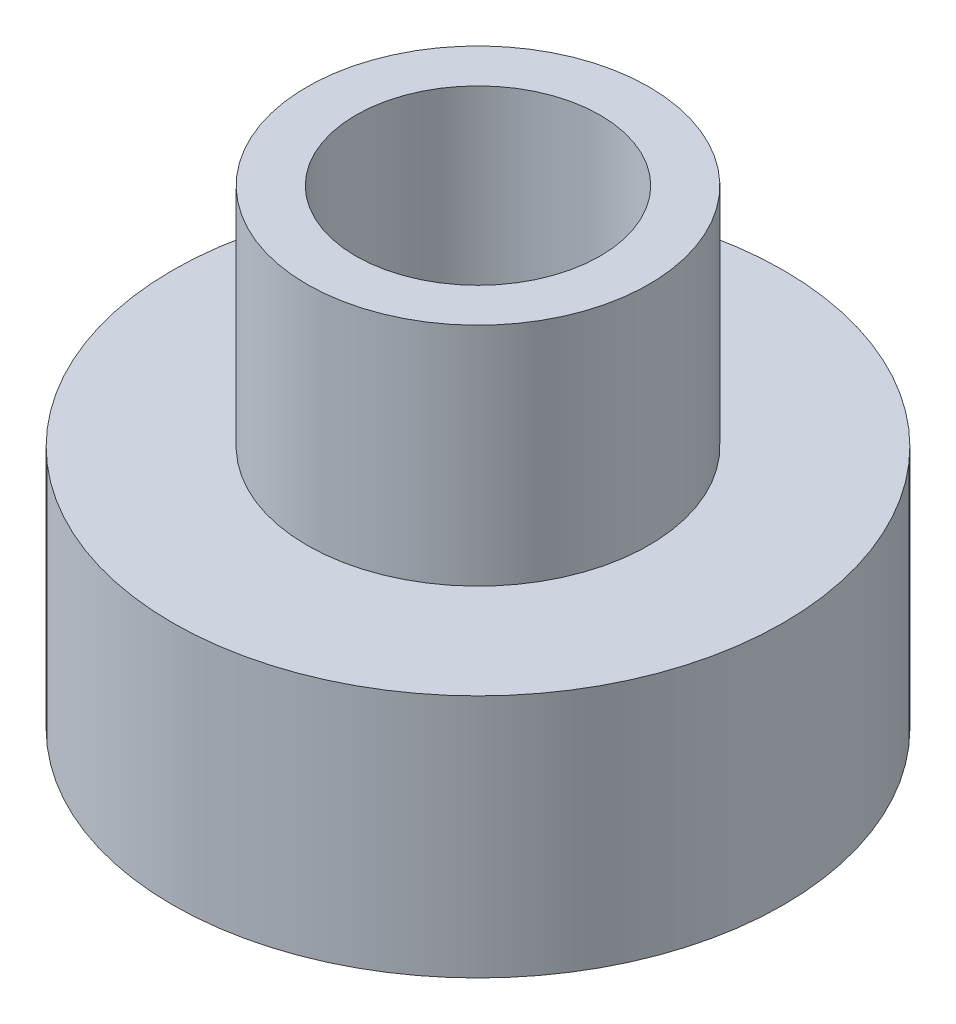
ISO-10303-21;
HEADER;
FILE_DESCRIPTION(('STEP AP214'),'2;1');
FILE_NAME('part.step','',(''),(''),'','','');
FILE_SCHEMA(('AUTOMOTIVE_DESIGN { 1 0 10303 214 1 1 1 1 }'));
ENDSEC;
DATA;
#1=APPLICATION_CONTEXT('core data for automotive mechanical design processes');
#2=APPLICATION_PROTOCOL_DEFINITION('international standard','automotive_design',2000,#1);
#3=PRODUCT_CONTEXT('',#1,'mechanical');
#4=PRODUCT('Part','Part','',(#3));
#5=PRODUCT_RELATED_PRODUCT_CATEGORY('part','',(#4));
#6=PRODUCT_DEFINITION_FORMATION('','',#4);
#7=PRODUCT_DEFINITION_CONTEXT('part definition',#1,'design');
#8=PRODUCT_DEFINITION('design','',#6,#7);
#9=PRODUCT_DEFINITION_SHAPE('','',#8);
#10=(LENGTH_UNIT() NAMED_UNIT(*) SI_UNIT(.MILLI.,.METRE.));
#11=(NAMED_UNIT(*) PLANE_ANGLE_UNIT() SI_UNIT($,.RADIAN.));
#12=(NAMED_UNIT(*) SI_UNIT($,.STERADIAN.) SOLID_ANGLE_UNIT());
#13=UNCERTAINTY_MEASURE_WITH_UNIT(LENGTH_MEASURE(1.E-05),#10,'distance_accuracy_value','');
#14=(GEOMETRIC_REPRESENTATION_CONTEXT(3) GLOBAL_UNCERTAINTY_ASSIGNED_CONTEXT((#13)) GLOBAL_UNIT_ASSIGNED_CONTEXT((#10,
#11,#12)) REPRESENTATION_CONTEXT('',''));
#15=CARTESIAN_POINT('',(0.,0.,0.));
#16=DIRECTION('',(0.,0.,1.));
#17=DIRECTION('',(1.,0.,0.));
#18=AXIS2_PLACEMENT_3D('',#15,#16,#17);
#19=CARTESIAN_POINT('',(-2.09558999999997,17.,-14.90441));
#20=DIRECTION('',(0.,1.,0.));
#21=DIRECTION('',(1.,0.,0.));
#22=AXIS2_PLACEMENT_3D('',#19,#20,#21);
#23=PLANE('',#22);
#24=CARTESIAN_POINT('',(0.,17.,-17.0000000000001));
#25=DIRECTION('',(0.,-1.,0.));
#26=DIRECTION('',(0.,0.,-1.));
#27=AXIS2_PLACEMENT_3D('',#24,#25,#26);
#28=CIRCLE('',#27,2.05450000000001);
#29=CARTESIAN_POINT('',(0.,17.,-19.0545000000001));
#30=VERTEX_POINT('',#29);
#31=EDGE_CURVE('E17',#30,#30,#28,.T.);
#32=ORIENTED_EDGE('',*,*,#31,.T.);
#33=EDGE_LOOP('',(#32));
#34=FACE_BOUND('',#33,.T.);
#35=ADVANCED_FACE('F13',(#34),#23,.F.);
#36=CARTESIAN_POINT('',(-14.90441,17.,2.09558999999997));
#37=DIRECTION('',(0.,1.,0.));
#38=DIRECTION('',(0.,0.,-1.));
#39=AXIS2_PLACEMENT_3D('',#36,#37,#38);
#40=PLANE('',#39);
#41=CARTESIAN_POINT('',(-17.,17.,0.));
#42=DIRECTION('',(0.,-1.,0.));
#43=DIRECTION('',(0.,0.,-1.));
#44=AXIS2_PLACEMENT_3D('',#41,#42,#43);
#45=CIRCLE('',#44,2.05450000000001);
#46=CARTESIAN_POINT('',(-17.,17.,-2.05450000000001));
#47=VERTEX_POINT('',#46);
#48=EDGE_CURVE('E86',#47,#47,#45,.T.);
#49=ORIENTED_EDGE('',*,*,#48,.T.);
#50=EDGE_LOOP('',(#49));
#51=FACE_BOUND('',#50,.T.);
#52=ADVANCED_FACE('F1664',(#51),#40,.F.);
#53=CARTESIAN_POINT('',(2.09558999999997,17.,14.90441));
#54=DIRECTION('',(0.,1.,0.));
#55=DIRECTION('',(-1.,0.,0.));
#56=AXIS2_PLACEMENT_3D('',#53,#54,#55);
#57=PLANE('',#56);
#58=CARTESIAN_POINT('',(0.,17.,17.0000000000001));
#59=DIRECTION('',(0.,-1.,0.));
#60=DIRECTION('',(0.,0.,-1.));
#61=AXIS2_PLACEMENT_3D('',#58,#59,#60);
#62=CIRCLE('',#61,2.05450000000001);
#63=CARTESIAN_POINT('',(0.,17.,14.9455));
#64=VERTEX_POINT('',#63);
#65=EDGE_CURVE('E84',#64,#64,#62,.T.);
#66=ORIENTED_EDGE('',*,*,#65,.T.);
#67=EDGE_LOOP('',(#66));
#68=FACE_BOUND('',#67,.T.);
#69=ADVANCED_FACE('F1657',(#68),#57,.F.);
#70=CARTESIAN_POINT('',(14.9044099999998,17.,-2.09559000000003));
#71=DIRECTION('',(0.,1.,0.));
#72=DIRECTION('',(0.,0.,1.));
#73=AXIS2_PLACEMENT_3D('',#70,#71,#72);
#74=PLANE('',#73);
#75=CARTESIAN_POINT('',(17.,17.,0.));
#76=DIRECTION('',(0.,-1.,0.));
#77=DIRECTION('',(0.,0.,-1.));
#78=AXIS2_PLACEMENT_3D('',#75,#76,#77);
#79=CIRCLE('',#78,2.05450000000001);
#80=CARTESIAN_POINT('',(17.,17.,-2.05450000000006));
#81=VERTEX_POINT('',#80);
#82=EDGE_CURVE('E80',#81,#81,#79,.T.);
#83=ORIENTED_EDGE('',*,*,#82,.T.);
#84=EDGE_LOOP('',(#83));
#85=FACE_BOUND('',#84,.T.);
#86=ADVANCED_FACE('F98',(#85),#74,.F.);
#87=CARTESIAN_POINT('',(0.,16.8132114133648,-17.0000000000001));
#88=DIRECTION('',(0.,-1.,0.));
#89=DIRECTION('',(0.,0.,-1.));
#90=AXIS2_PLACEMENT_3D('',#87,#88,#89);
#91=CONICAL_SURFACE('',#90,2.24128858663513,0.785398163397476);
#92=ORIENTED_EDGE('',*,*,#31,.F.);
#93=EDGE_LOOP('',(#92));
#94=FACE_BOUND('',#93,.T.);
#95=CARTESIAN_POINT('',(0.,16.8132114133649,-17.0000000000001));
#96=DIRECTION('',(0.,-1.,0.));
#97=DIRECTION('',(0.,0.,-1.));
#98=AXIS2_PLACEMENT_3D('',#95,#96,#97);
#99=CIRCLE('',#98,2.2412885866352);
#100=CARTESIAN_POINT('',(0.,16.8132114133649,-19.2412885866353));
#101=VERTEX_POINT('',#100);
#102=EDGE_CURVE('E83',#101,#101,#99,.T.);
#103=ORIENTED_EDGE('',*,*,#102,.T.);
#104=EDGE_LOOP('',(#103));
#105=FACE_BOUND('',#104,.T.);
#106=ADVANCED_FACE('F94',(#94,#105),#91,.F.);
#107=CARTESIAN_POINT('',(-17.,16.8132114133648,0.));
#108=DIRECTION('',(0.,-1.,0.));
#109=DIRECTION('',(0.,0.,-1.));
#110=AXIS2_PLACEMENT_3D('',#107,#108,#109);
#111=CONICAL_SURFACE('',#110,2.24128858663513,0.785398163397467);
#112=ORIENTED_EDGE('',*,*,#48,.F.);
#113=EDGE_LOOP('',(#112));
#114=FACE_BOUND('',#113,.T.);
#115=CARTESIAN_POINT('',(-17.,16.8132114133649,0.));
#116=DIRECTION('',(0.,-1.,0.));
#117=DIRECTION('',(0.,0.,-1.));
#118=AXIS2_PLACEMENT_3D('',#115,#116,#117);
#119=CIRCLE('',#118,2.2412885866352);
#120=CARTESIAN_POINT('',(-17.,16.8132114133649,-2.24128858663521));
#121=VERTEX_POINT('',#120);
#122=EDGE_CURVE('E103',#121,#121,#119,.T.);
#123=ORIENTED_EDGE('',*,*,#122,.T.);
#124=EDGE_LOOP('',(#123));
#125=FACE_BOUND('',#124,.T.);
#126=ADVANCED_FACE('F97',(#114,#125),#111,.F.);
#127=CARTESIAN_POINT('',(0.,16.8132114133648,17.0000000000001));
#128=DIRECTION('',(0.,-1.,0.));
#129=DIRECTION('',(0.,0.,-1.));
#130=AXIS2_PLACEMENT_3D('',#127,#128,#129);
#131=CONICAL_SURFACE('',#130,2.24128858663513,0.785398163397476);
#132=ORIENTED_EDGE('',*,*,#65,.F.);
#133=EDGE_LOOP('',(#132));
#134=FACE_BOUND('',#133,.T.);
#135=CARTESIAN_POINT('',(0.,16.8132114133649,17.0000000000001));
#136=DIRECTION('',(0.,-1.,0.));
#137=DIRECTION('',(0.,0.,-1.));
#138=AXIS2_PLACEMENT_3D('',#135,#136,#137);
#139=CIRCLE('',#138,2.2412885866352);
#140=CARTESIAN_POINT('',(0.,16.8132114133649,14.7587114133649));
#141=VERTEX_POINT('',#140);
#142=EDGE_CURVE('E105',#141,#141,#139,.T.);
#143=ORIENTED_EDGE('',*,*,#142,.T.);
#144=EDGE_LOOP('',(#143));
#145=FACE_BOUND('',#144,.T.);
#146=ADVANCED_FACE('F879',(#134,#145),#131,.F.);
#147=CARTESIAN_POINT('',(17.,16.8132114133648,0.));
#148=DIRECTION('',(0.,-1.,0.));
#149=DIRECTION('',(0.,0.,-1.));
#150=AXIS2_PLACEMENT_3D('',#147,#148,#149);
#151=CONICAL_SURFACE('',#150,2.24128858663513,0.785398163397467);
#152=ORIENTED_EDGE('',*,*,#82,.F.);
#153=EDGE_LOOP('',(#152));
#154=FACE_BOUND('',#153,.T.);
#155=CARTESIAN_POINT('',(17.,16.8132114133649,0.));
#156=DIRECTION('',(0.,-1.,0.));
#157=DIRECTION('',(0.,0.,-1.));
#158=AXIS2_PLACEMENT_3D('',#155,#156,#157);
#159=CIRCLE('',#158,2.24128858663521);
#160=CARTESIAN_POINT('',(17.,16.8132114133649,-2.24128858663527));
#161=VERTEX_POINT('',#160);
#162=EDGE_CURVE('E114',#161,#161,#159,.T.);
#163=ORIENTED_EDGE('',*,*,#162,.T.);
#164=EDGE_LOOP('',(#163));
#165=FACE_BOUND('',#164,.T.);
#166=ADVANCED_FACE('F885',(#154,#165),#151,.F.);
#167=CARTESIAN_POINT('',(0.,16.6455,-17.0000000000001));
#168=DIRECTION('',(0.,1.,0.));
#169=DIRECTION('',(-1.,0.,0.));
#170=AXIS2_PLACEMENT_3D('',#167,#168,#169);
#171=CONICAL_SURFACE('',#170,2.0545,0.839160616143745);
#172=CARTESIAN_POINT('',(0.,16.6455,-17.0000000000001));
#173=DIRECTION('',(0.,-1.,0.));
#174=DIRECTION('',(0.,0.,-1.));
#175=AXIS2_PLACEMENT_3D('',#172,#173,#174);
#176=CIRCLE('',#175,2.05450000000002);
#177=CARTESIAN_POINT('',(0.,16.6455,-19.0545000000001));
#178=VERTEX_POINT('',#177);
#179=EDGE_CURVE('E119',#178,#178,#176,.T.);
#180=ORIENTED_EDGE('',*,*,#179,.T.);
#181=EDGE_LOOP('',(#180));
#182=FACE_BOUND('',#181,.T.);
#183=ORIENTED_EDGE('',*,*,#102,.F.);
#184=EDGE_LOOP('',(#183));
#185=FACE_BOUND('',#184,.T.);
#186=ADVANCED_FACE('F874',(#182,#185),#171,.F.);
#187=CARTESIAN_POINT('',(-17.,16.6455,0.));
#188=DIRECTION('',(0.,1.,0.));
#189=DIRECTION('',(0.,0.,1.));
#190=AXIS2_PLACEMENT_3D('',#187,#188,#189);
#191=CONICAL_SURFACE('',#190,2.0545,0.839160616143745);
#192=CARTESIAN_POINT('',(-17.,16.6455,0.));
#193=DIRECTION('',(0.,-1.,0.));
#194=DIRECTION('',(0.,0.,-1.));
#195=AXIS2_PLACEMENT_3D('',#192,#193,#194);
#196=CIRCLE('',#195,2.05450000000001);
#197=CARTESIAN_POINT('',(-17.,16.6455,-2.05450000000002));
#198=VERTEX_POINT('',#197);
#199=EDGE_CURVE('E124',#198,#198,#196,.T.);
#200=ORIENTED_EDGE('',*,*,#199,.T.);
#201=EDGE_LOOP('',(#200));
#202=FACE_BOUND('',#201,.T.);
#203=ORIENTED_EDGE('',*,*,#122,.F.);
#204=EDGE_LOOP('',(#203));
#205=FACE_BOUND('',#204,.T.);
#206=ADVANCED_FACE('F870',(#202,#205),#191,.F.);
#207=CARTESIAN_POINT('',(0.,16.6455,17.0000000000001));
#208=DIRECTION('',(0.,1.,0.));
#209=DIRECTION('',(-1.,0.,0.));
#210=AXIS2_PLACEMENT_3D('',#207,#208,#209);
#211=CONICAL_SURFACE('',#210,2.0545,0.839160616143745);
#212=CARTESIAN_POINT('',(0.,16.6455,17.0000000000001));
#213=DIRECTION('',(0.,-1.,0.));
#214=DIRECTION('',(0.,0.,-1.));
#215=AXIS2_PLACEMENT_3D('',#212,#213,#214);
#216=CIRCLE('',#215,2.05450000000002);
#217=CARTESIAN_POINT('',(0.,16.6455,14.9455));
#218=VERTEX_POINT('',#217);
#219=EDGE_CURVE('E129',#218,#218,#216,.T.);
#220=ORIENTED_EDGE('',*,*,#219,.T.);
#221=EDGE_LOOP('',(#220));
#222=FACE_BOUND('',#221,.T.);
#223=ORIENTED_EDGE('',*,*,#142,.F.);
#224=EDGE_LOOP('',(#223));
#225=FACE_BOUND('',#224,.T.);
#226=ADVANCED_FACE('F873',(#222,#225),#211,.F.);
#227=CARTESIAN_POINT('',(17.,16.6455,0.));
#228=DIRECTION('',(0.,1.,0.));
#229=DIRECTION('',(0.,0.,1.));
#230=AXIS2_PLACEMENT_3D('',#227,#228,#229);
#231=CONICAL_SURFACE('',#230,2.0545,0.839160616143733);
#232=CARTESIAN_POINT('',(17.,16.6455,0.));
#233=DIRECTION('',(0.,-1.,0.));
#234=DIRECTION('',(0.,0.,-1.));
#235=AXIS2_PLACEMENT_3D('',#232,#233,#234);
#236=CIRCLE('',#235,2.05450000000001);
#237=CARTESIAN_POINT('',(17.,16.6455,-2.05450000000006));
#238=VERTEX_POINT('',#237);
#239=EDGE_CURVE('E134',#238,#238,#236,.T.);
#240=ORIENTED_EDGE('',*,*,#239,.T.);
#241=EDGE_LOOP('',(#240));
#242=FACE_BOUND('',#241,.T.);
#243=ORIENTED_EDGE('',*,*,#162,.F.);
#244=EDGE_LOOP('',(#243));
#245=FACE_BOUND('',#244,.T.);
#246=ADVANCED_FACE('F898',(#242,#245),#231,.F.);
#247=CARTESIAN_POINT('',(0.,16.2455,-17.0000000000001));
#248=DIRECTION('',(0.,-1.,0.));
#249=DIRECTION('',(0.,0.,-1.));
#250=AXIS2_PLACEMENT_3D('',#247,#248,#249);
#251=CONICAL_SURFACE('',#250,2.5,0.839160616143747);
#252=CARTESIAN_POINT('',(0.,16.2455,-17.0000000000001));
#253=DIRECTION('',(0.,-1.,0.));
#254=DIRECTION('',(0.,0.,-1.));
#255=AXIS2_PLACEMENT_3D('',#252,#253,#254);
#256=CIRCLE('',#255,2.49999999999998);
#257=CARTESIAN_POINT('',(0.,16.2455,-19.5));
#258=VERTEX_POINT('',#257);
#259=EDGE_CURVE('E139',#258,#258,#256,.T.);
#260=ORIENTED_EDGE('',*,*,#259,.T.);
#261=EDGE_LOOP('',(#260));
#262=FACE_BOUND('',#261,.T.);
#263=ORIENTED_EDGE('',*,*,#179,.F.);
#264=EDGE_LOOP('',(#263));
#265=FACE_BOUND('',#264,.T.);
#266=ADVANCED_FACE('F866',(#262,#265),#251,.F.);
#267=CARTESIAN_POINT('',(-17.,16.2455,0.));
#268=DIRECTION('',(0.,-1.,0.));
#269=DIRECTION('',(0.,0.,-1.));
#270=AXIS2_PLACEMENT_3D('',#267,#268,#269);
#271=CONICAL_SURFACE('',#270,2.5,0.839160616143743);
#272=CARTESIAN_POINT('',(-17.,16.2455,0.));
#273=DIRECTION('',(0.,-1.,0.));
#274=DIRECTION('',(0.,0.,-1.));
#275=AXIS2_PLACEMENT_3D('',#272,#273,#274);
#276=CIRCLE('',#275,2.49999999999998);
#277=CARTESIAN_POINT('',(-17.,16.2455,-2.49999999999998));
#278=VERTEX_POINT('',#277);
#279=EDGE_CURVE('E144',#278,#278,#276,.T.);
#280=ORIENTED_EDGE('',*,*,#279,.T.);
#281=EDGE_LOOP('',(#280));
#282=FACE_BOUND('',#281,.T.);
#283=ORIENTED_EDGE('',*,*,#199,.F.);
#284=EDGE_LOOP('',(#283));
#285=FACE_BOUND('',#284,.T.);
#286=ADVANCED_FACE('F862',(#282,#285),#271,.F.);
#287=CARTESIAN_POINT('',(0.,16.2455,17.0000000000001));
#288=DIRECTION('',(0.,-1.,0.));
#289=DIRECTION('',(0.,0.,-1.));
#290=AXIS2_PLACEMENT_3D('',#287,#288,#289);
#291=CONICAL_SURFACE('',#290,2.5,0.839160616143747);
#292=CARTESIAN_POINT('',(0.,16.2455,17.0000000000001));
#293=DIRECTION('',(0.,-1.,0.));
#294=DIRECTION('',(0.,0.,-1.));
#295=AXIS2_PLACEMENT_3D('',#292,#293,#294);
#296=CIRCLE('',#295,2.49999999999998);
#297=CARTESIAN_POINT('',(0.,16.2455,14.5000000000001));
#298=VERTEX_POINT('',#297);
#299=EDGE_CURVE('E149',#298,#298,#296,.T.);
#300=ORIENTED_EDGE('',*,*,#299,.T.);
#301=EDGE_LOOP('',(#300));
#302=FACE_BOUND('',#301,.T.);
#303=ORIENTED_EDGE('',*,*,#219,.F.);
#304=EDGE_LOOP('',(#303));
#305=FACE_BOUND('',#304,.T.);
#306=ADVANCED_FACE('F865',(#302,#305),#291,.F.);
#307=CARTESIAN_POINT('',(17.,16.2455,0.));
#308=DIRECTION('',(0.,-1.,0.));
#309=DIRECTION('',(0.,0.,-1.));
#310=AXIS2_PLACEMENT_3D('',#307,#308,#309);
#311=CONICAL_SURFACE('',#310,2.5,0.839160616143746);
#312=CARTESIAN_POINT('',(17.,16.2455,0.));
#313=DIRECTION('',(0.,-1.,0.));
#314=DIRECTION('',(0.,0.,-1.));
#315=AXIS2_PLACEMENT_3D('',#312,#313,#314);
#316=CIRCLE('',#315,2.49999999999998);
#317=CARTESIAN_POINT('',(17.,16.2455,-2.50000000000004));
#318=VERTEX_POINT('',#317);
#319=EDGE_CURVE('E154',#318,#318,#316,.T.);
#320=ORIENTED_EDGE('',*,*,#319,.T.);
#321=EDGE_LOOP('',(#320));
#322=FACE_BOUND('',#321,.T.);
#323=ORIENTED_EDGE('',*,*,#239,.F.);
#324=EDGE_LOOP('',(#323));
#325=FACE_BOUND('',#324,.T.);
#326=ADVANCED_FACE('F908',(#322,#325),#311,.F.);
#327=CARTESIAN_POINT('',(0.,15.8454999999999,-17.0000000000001));
#328=DIRECTION('',(0.,1.,0.));
#329=DIRECTION('',(0.,0.,1.));
#330=AXIS2_PLACEMENT_3D('',#327,#328,#329);
#331=CONICAL_SURFACE('',#330,2.05449999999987,0.839160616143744);
#332=CARTESIAN_POINT('',(0.,15.8455,-17.0000000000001));
#333=DIRECTION('',(0.,-1.,0.));
#334=DIRECTION('',(0.,0.,-1.));
#335=AXIS2_PLACEMENT_3D('',#332,#333,#334);
#336=CIRCLE('',#335,2.05449999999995);
#337=CARTESIAN_POINT('',(0.,15.8455,-19.0545));
#338=VERTEX_POINT('',#337);
#339=EDGE_CURVE('E159',#338,#338,#336,.T.);
#340=ORIENTED_EDGE('',*,*,#339,.T.);
#341=EDGE_LOOP('',(#340));
#342=FACE_BOUND('',#341,.T.);
#343=ORIENTED_EDGE('',*,*,#259,.F.);
#344=EDGE_LOOP('',(#343));
#345=FACE_BOUND('',#344,.T.);
#346=ADVANCED_FACE('F858',(#342,#345),#331,.F.);
#347=CARTESIAN_POINT('',(-17.,15.8454999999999,0.));
#348=DIRECTION('',(0.,1.,0.));
#349=DIRECTION('',(0.,0.,1.));
#350=AXIS2_PLACEMENT_3D('',#347,#348,#349);
#351=CONICAL_SURFACE('',#350,2.05449999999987,0.839160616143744);
#352=CARTESIAN_POINT('',(-17.,15.8455,0.));
#353=DIRECTION('',(0.,-1.,0.));
#354=DIRECTION('',(0.,0.,-1.));
#355=AXIS2_PLACEMENT_3D('',#352,#353,#354);
#356=CIRCLE('',#355,2.05449999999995);
#357=CARTESIAN_POINT('',(-17.,15.8455,-2.05449999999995));
#358=VERTEX_POINT('',#357);
#359=EDGE_CURVE('E164',#358,#358,#356,.T.);
#360=ORIENTED_EDGE('',*,*,#359,.T.);
#361=EDGE_LOOP('',(#360));
#362=FACE_BOUND('',#361,.T.);
#363=ORIENTED_EDGE('',*,*,#279,.F.);
#364=EDGE_LOOP('',(#363));
#365=FACE_BOUND('',#364,.T.);
#366=ADVANCED_FACE('F854',(#362,#365),#351,.F.);
#367=CARTESIAN_POINT('',(0.,15.8454999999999,17.0000000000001));
#368=DIRECTION('',(0.,1.,0.));
#369=DIRECTION('',(0.,0.,1.));
#370=AXIS2_PLACEMENT_3D('',#367,#368,#369);
#371=CONICAL_SURFACE('',#370,2.05449999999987,0.839160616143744);
#372=CARTESIAN_POINT('',(0.,15.8455,17.0000000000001));
#373=DIRECTION('',(0.,-1.,0.));
#374=DIRECTION('',(0.,0.,-1.));
#375=AXIS2_PLACEMENT_3D('',#372,#373,#374);
#376=CIRCLE('',#375,2.05449999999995);
#377=CARTESIAN_POINT('',(0.,15.8455,14.9455000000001));
#378=VERTEX_POINT('',#377);
#379=EDGE_CURVE('E169',#378,#378,#376,.T.);
#380=ORIENTED_EDGE('',*,*,#379,.T.);
#381=EDGE_LOOP('',(#380));
#382=FACE_BOUND('',#381,.T.);
#383=ORIENTED_EDGE('',*,*,#299,.F.);
#384=EDGE_LOOP('',(#383));
#385=FACE_BOUND('',#384,.T.);
#386=ADVANCED_FACE('F857',(#382,#385),#371,.F.);
#387=CARTESIAN_POINT('',(17.,15.8454999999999,0.));
#388=DIRECTION('',(0.,1.,0.));
#389=DIRECTION('',(0.,0.,1.));
#390=AXIS2_PLACEMENT_3D('',#387,#388,#389);
#391=CONICAL_SURFACE('',#390,2.05449999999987,0.839160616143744);
#392=CARTESIAN_POINT('',(17.,15.8455,0.));
#393=DIRECTION('',(0.,-1.,0.));
#394=DIRECTION('',(0.,0.,-1.));
#395=AXIS2_PLACEMENT_3D('',#392,#393,#394);
#396=CIRCLE('',#395,2.05449999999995);
#397=CARTESIAN_POINT('',(17.,15.8455,-2.05450000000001));
#398=VERTEX_POINT('',#397);
#399=EDGE_CURVE('E174',#398,#398,#396,.T.);
#400=ORIENTED_EDGE('',*,*,#399,.T.);
#401=EDGE_LOOP('',(#400));
#402=FACE_BOUND('',#401,.T.);
#403=ORIENTED_EDGE('',*,*,#319,.F.);
#404=EDGE_LOOP('',(#403));
#405=FACE_BOUND('',#404,.T.);
#406=ADVANCED_FACE('F918',(#402,#405),#391,.F.);
#407=CARTESIAN_POINT('',(0.,15.4454999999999,-17.0000000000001));
#408=DIRECTION('',(0.,-1.,0.));
#409=DIRECTION('',(1.,0.,0.));
#410=AXIS2_PLACEMENT_3D('',#407,#408,#409);
#411=CONICAL_SURFACE('',#410,2.50000000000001,0.839160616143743);
#412=CARTESIAN_POINT('',(0.,15.4454999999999,-17.0000000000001));
#413=DIRECTION('',(0.,-1.,0.));
#414=DIRECTION('',(1.,0.,0.));
#415=AXIS2_PLACEMENT_3D('',#412,#413,#414);
#416=CIRCLE('',#415,2.49999999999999);
#417=CARTESIAN_POINT('',(2.49999999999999,15.4454999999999,-17.0000000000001));
#418=VERTEX_POINT('',#417);
#419=EDGE_CURVE('E179',#418,#418,#416,.T.);
#420=ORIENTED_EDGE('',*,*,#419,.T.);
#421=EDGE_LOOP('',(#420));
#422=FACE_BOUND('',#421,.T.);
#423=ORIENTED_EDGE('',*,*,#339,.F.);
#424=EDGE_LOOP('',(#423));
#425=FACE_BOUND('',#424,.T.);
#426=ADVANCED_FACE('F850',(#422,#425),#411,.F.);
#427=CARTESIAN_POINT('',(-17.,15.4454999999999,0.));
#428=DIRECTION('',(0.,-1.,0.));
#429=DIRECTION('',(0.,0.,-1.));
#430=AXIS2_PLACEMENT_3D('',#427,#428,#429);
#431=CONICAL_SURFACE('',#430,2.50000000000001,0.839160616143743);
#432=CARTESIAN_POINT('',(-17.,15.4454999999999,0.));
#433=DIRECTION('',(0.,-1.,0.));
#434=DIRECTION('',(0.,0.,-1.));
#435=AXIS2_PLACEMENT_3D('',#432,#433,#434);
#436=CIRCLE('',#435,2.49999999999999);
#437=CARTESIAN_POINT('',(-17.,15.4454999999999,-2.49999999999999));
#438=VERTEX_POINT('',#437);
#439=EDGE_CURVE('E184',#438,#438,#436,.T.);
#440=ORIENTED_EDGE('',*,*,#439,.T.);
#441=EDGE_LOOP('',(#440));
#442=FACE_BOUND('',#441,.T.);
#443=ORIENTED_EDGE('',*,*,#359,.F.);
#444=EDGE_LOOP('',(#443));
#445=FACE_BOUND('',#444,.T.);
#446=ADVANCED_FACE('F846',(#442,#445),#431,.F.);
#447=CARTESIAN_POINT('',(0.,15.4454999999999,17.0000000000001));
#448=DIRECTION('',(0.,-1.,0.));
#449=DIRECTION('',(1.,0.,0.));
#450=AXIS2_PLACEMENT_3D('',#447,#448,#449);
#451=CONICAL_SURFACE('',#450,2.50000000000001,0.839160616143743);
#452=CARTESIAN_POINT('',(0.,15.4454999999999,17.0000000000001));
#453=DIRECTION('',(0.,-1.,0.));
#454=DIRECTION('',(1.,0.,0.));
#455=AXIS2_PLACEMENT_3D('',#452,#453,#454);
#456=CIRCLE('',#455,2.49999999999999);
#457=CARTESIAN_POINT('',(2.49999999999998,15.4454999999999,17.0000000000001));
#458=VERTEX_POINT('',#457);
#459=EDGE_CURVE('E189',#458,#458,#456,.T.);
#460=ORIENTED_EDGE('',*,*,#459,.T.);
#461=EDGE_LOOP('',(#460));
#462=FACE_BOUND('',#461,.T.);
#463=ORIENTED_EDGE('',*,*,#379,.F.);
#464=EDGE_LOOP('',(#463));
#465=FACE_BOUND('',#464,.T.);
#466=ADVANCED_FACE('F849',(#462,#465),#451,.F.);
#467=CARTESIAN_POINT('',(17.,15.4454999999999,0.));
#468=DIRECTION('',(0.,-1.,0.));
#469=DIRECTION('',(0.,0.,-1.));
#470=AXIS2_PLACEMENT_3D('',#467,#468,#469);
#471=CONICAL_SURFACE('',#470,2.5,0.839160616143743);
#472=CARTESIAN_POINT('',(17.,15.4454999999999,0.));
#473=DIRECTION('',(0.,-1.,0.));
#474=DIRECTION('',(0.,0.,-1.));
#475=AXIS2_PLACEMENT_3D('',#472,#473,#474);
#476=CIRCLE('',#475,2.49999999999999);
#477=CARTESIAN_POINT('',(17.,15.4454999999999,-2.50000000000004));
#478=VERTEX_POINT('',#477);
#479=EDGE_CURVE('E194',#478,#478,#476,.T.);
#480=ORIENTED_EDGE('',*,*,#479,.T.);
#481=EDGE_LOOP('',(#480));
#482=FACE_BOUND('',#481,.T.);
#483=ORIENTED_EDGE('',*,*,#399,.F.);
#484=EDGE_LOOP('',(#483));
#485=FACE_BOUND('',#484,.T.);
#486=ADVANCED_FACE('F928',(#482,#485),#471,.F.);
#487=CARTESIAN_POINT('',(0.,15.0454999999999,-17.0000000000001));
#488=DIRECTION('',(0.,1.,0.));
#489=DIRECTION('',(-1.,0.,0.));
#490=AXIS2_PLACEMENT_3D('',#487,#488,#489);
#491=CONICAL_SURFACE('',#490,2.0545,0.839160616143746);
#492=CARTESIAN_POINT('',(0.,15.0455,-17.0000000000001));
#493=DIRECTION('',(0.,-1.,0.));
#494=DIRECTION('',(1.,0.,0.));
#495=AXIS2_PLACEMENT_3D('',#492,#493,#494);
#496=CIRCLE('',#495,2.05450000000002);
#497=CARTESIAN_POINT('',(2.05450000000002,15.0455,-17.0000000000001));
#498=VERTEX_POINT('',#497);
#499=EDGE_CURVE('E199',#498,#498,#496,.T.);
#500=ORIENTED_EDGE('',*,*,#499,.T.);
#501=EDGE_LOOP('',(#500));
#502=FACE_BOUND('',#501,.T.);
#503=ORIENTED_EDGE('',*,*,#419,.F.);
#504=EDGE_LOOP('',(#503));
#505=FACE_BOUND('',#504,.T.);
#506=ADVANCED_FACE('F842',(#502,#505),#491,.F.);
#507=CARTESIAN_POINT('',(-17.,15.0454999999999,0.));
#508=DIRECTION('',(0.,1.,0.));
#509=DIRECTION('',(0.,0.,1.));
#510=AXIS2_PLACEMENT_3D('',#507,#508,#509);
#511=CONICAL_SURFACE('',#510,2.0545,0.839160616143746);
#512=CARTESIAN_POINT('',(-17.,15.0455,0.));
#513=DIRECTION('',(0.,-1.,0.));
#514=DIRECTION('',(0.,0.,-1.));
#515=AXIS2_PLACEMENT_3D('',#512,#513,#514);
#516=CIRCLE('',#515,2.05450000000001);
#517=CARTESIAN_POINT('',(-17.,15.0455,-2.05450000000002));
#518=VERTEX_POINT('',#517);
#519=EDGE_CURVE('E204',#518,#518,#516,.T.);
#520=ORIENTED_EDGE('',*,*,#519,.T.);
#521=EDGE_LOOP('',(#520));
#522=FACE_BOUND('',#521,.T.);
#523=ORIENTED_EDGE('',*,*,#439,.F.);
#524=EDGE_LOOP('',(#523));
#525=FACE_BOUND('',#524,.T.);
#526=ADVANCED_FACE('F838',(#522,#525),#511,.F.);
#527=CARTESIAN_POINT('',(0.,15.0454999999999,17.0000000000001));
#528=DIRECTION('',(0.,1.,0.));
#529=DIRECTION('',(-1.,0.,0.));
#530=AXIS2_PLACEMENT_3D('',#527,#528,#529);
#531=CONICAL_SURFACE('',#530,2.0545,0.839160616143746);
#532=CARTESIAN_POINT('',(0.,15.0455,17.0000000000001));
#533=DIRECTION('',(0.,-1.,0.));
#534=DIRECTION('',(1.,0.,0.));
#535=AXIS2_PLACEMENT_3D('',#532,#533,#534);
#536=CIRCLE('',#535,2.05450000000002);
#537=CARTESIAN_POINT('',(2.05450000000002,15.0455,17.0000000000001));
#538=VERTEX_POINT('',#537);
#539=EDGE_CURVE('E209',#538,#538,#536,.T.);
#540=ORIENTED_EDGE('',*,*,#539,.T.);
#541=EDGE_LOOP('',(#540));
#542=FACE_BOUND('',#541,.T.);
#543=ORIENTED_EDGE('',*,*,#459,.F.);
#544=EDGE_LOOP('',(#543));
#545=FACE_BOUND('',#544,.T.);
#546=ADVANCED_FACE('F841',(#542,#545),#531,.F.);
#547=CARTESIAN_POINT('',(17.,15.0454999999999,0.));
#548=DIRECTION('',(0.,1.,0.));
#549=DIRECTION('',(0.,0.,1.));
#550=AXIS2_PLACEMENT_3D('',#547,#548,#549);
#551=CONICAL_SURFACE('',#550,2.0545,0.839160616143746);
#552=CARTESIAN_POINT('',(17.,15.0455,0.));
#553=DIRECTION('',(0.,-1.,0.));
#554=DIRECTION('',(0.,0.,-1.));
#555=AXIS2_PLACEMENT_3D('',#552,#553,#554);
#556=CIRCLE('',#555,2.05450000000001);
#557=CARTESIAN_POINT('',(17.,15.0455,-2.05450000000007));
#558=VERTEX_POINT('',#557);
#559=EDGE_CURVE('E214',#558,#558,#556,.T.);
#560=ORIENTED_EDGE('',*,*,#559,.T.);
#561=EDGE_LOOP('',(#560));
#562=FACE_BOUND('',#561,.T.);
#563=ORIENTED_EDGE('',*,*,#479,.F.);
#564=EDGE_LOOP('',(#563));
#565=FACE_BOUND('',#564,.T.);
#566=ADVANCED_FACE('F938',(#562,#565),#551,.F.);
#567=CARTESIAN_POINT('',(0.,14.6455,-17.0000000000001));
#568=DIRECTION('',(0.,-1.,0.));
#569=DIRECTION('',(1.,0.,0.));
#570=AXIS2_PLACEMENT_3D('',#567,#568,#569);
#571=CONICAL_SURFACE('',#570,2.50000000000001,0.839160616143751);
#572=CARTESIAN_POINT('',(0.,14.6455,-17.0000000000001));
#573=DIRECTION('',(0.,-1.,0.));
#574=DIRECTION('',(1.,0.,0.));
#575=AXIS2_PLACEMENT_3D('',#572,#573,#574);
#576=CIRCLE('',#575,2.49999999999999);
#577=CARTESIAN_POINT('',(2.49999999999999,14.6455,-17.0000000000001));
#578=VERTEX_POINT('',#577);
#579=EDGE_CURVE('E219',#578,#578,#576,.T.);
#580=ORIENTED_EDGE('',*,*,#579,.T.);
#581=EDGE_LOOP('',(#580));
#582=FACE_BOUND('',#581,.T.);
#583=ORIENTED_EDGE('',*,*,#499,.F.);
#584=EDGE_LOOP('',(#583));
#585=FACE_BOUND('',#584,.T.);
#586=ADVANCED_FACE('F834',(#582,#585),#571,.F.);
#587=CARTESIAN_POINT('',(-17.,14.6455,0.));
#588=DIRECTION('',(0.,-1.,0.));
#589=DIRECTION('',(0.,0.,-1.));
#590=AXIS2_PLACEMENT_3D('',#587,#588,#589);
#591=CONICAL_SURFACE('',#590,2.50000000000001,0.839160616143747);
#592=CARTESIAN_POINT('',(-17.,14.6455,0.));
#593=DIRECTION('',(0.,-1.,0.));
#594=DIRECTION('',(0.,0.,-1.));
#595=AXIS2_PLACEMENT_3D('',#592,#593,#594);
#596=CIRCLE('',#595,2.49999999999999);
#597=CARTESIAN_POINT('',(-17.,14.6455,-2.49999999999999));
#598=VERTEX_POINT('',#597);
#599=EDGE_CURVE('E224',#598,#598,#596,.T.);
#600=ORIENTED_EDGE('',*,*,#599,.T.);
#601=EDGE_LOOP('',(#600));
#602=FACE_BOUND('',#601,.T.);
#603=ORIENTED_EDGE('',*,*,#519,.F.);
#604=EDGE_LOOP('',(#603));
#605=FACE_BOUND('',#604,.T.);
#606=ADVANCED_FACE('F830',(#602,#605),#591,.F.);
#607=CARTESIAN_POINT('',(0.,14.6455,17.0000000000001));
#608=DIRECTION('',(0.,-1.,0.));
#609=DIRECTION('',(1.,0.,0.));
#610=AXIS2_PLACEMENT_3D('',#607,#608,#609);
#611=CONICAL_SURFACE('',#610,2.50000000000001,0.839160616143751);
#612=CARTESIAN_POINT('',(0.,14.6455,17.0000000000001));
#613=DIRECTION('',(0.,-1.,0.));
#614=DIRECTION('',(1.,0.,0.));
#615=AXIS2_PLACEMENT_3D('',#612,#613,#614);
#616=CIRCLE('',#615,2.49999999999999);
#617=CARTESIAN_POINT('',(2.49999999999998,14.6455,17.0000000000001));
#618=VERTEX_POINT('',#617);
#619=EDGE_CURVE('E229',#618,#618,#616,.T.);
#620=ORIENTED_EDGE('',*,*,#619,.T.);
#621=EDGE_LOOP('',(#620));
#622=FACE_BOUND('',#621,.T.);
#623=ORIENTED_EDGE('',*,*,#539,.F.);
#624=EDGE_LOOP('',(#623));
#625=FACE_BOUND('',#624,.T.);
#626=ADVANCED_FACE('F833',(#622,#625),#611,.F.);
#627=CARTESIAN_POINT('',(17.,14.6455,0.));
#628=DIRECTION('',(0.,-1.,0.));
#629=DIRECTION('',(0.,0.,-1.));
#630=AXIS2_PLACEMENT_3D('',#627,#628,#629);
#631=CONICAL_SURFACE('',#630,2.5,0.839160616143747);
#632=CARTESIAN_POINT('',(17.,14.6455,0.));
#633=DIRECTION('',(0.,-1.,0.));
#634=DIRECTION('',(0.,0.,-1.));
#635=AXIS2_PLACEMENT_3D('',#632,#633,#634);
#636=CIRCLE('',#635,2.49999999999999);
#637=CARTESIAN_POINT('',(17.,14.6455,-2.50000000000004));
#638=VERTEX_POINT('',#637);
#639=EDGE_CURVE('E234',#638,#638,#636,.T.);
#640=ORIENTED_EDGE('',*,*,#639,.T.);
#641=EDGE_LOOP('',(#640));
#642=FACE_BOUND('',#641,.T.);
#643=ORIENTED_EDGE('',*,*,#559,.F.);
#644=EDGE_LOOP('',(#643));
#645=FACE_BOUND('',#644,.T.);
#646=ADVANCED_FACE('F948',(#642,#645),#631,.F.);
#647=CARTESIAN_POINT('',(0.,14.2455,-17.0000000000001));
#648=DIRECTION('',(0.,1.,0.));
#649=DIRECTION('',(-1.,0.,0.));
#650=AXIS2_PLACEMENT_3D('',#647,#648,#649);
#651=CONICAL_SURFACE('',#650,2.0545,0.839160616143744);
#652=CARTESIAN_POINT('',(0.,14.2455,-17.0000000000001));
#653=DIRECTION('',(0.,-1.,0.));
#654=DIRECTION('',(1.,0.,0.));
#655=AXIS2_PLACEMENT_3D('',#652,#653,#654);
#656=CIRCLE('',#655,2.05450000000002);
#657=CARTESIAN_POINT('',(2.05450000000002,14.2455,-17.0000000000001));
#658=VERTEX_POINT('',#657);
#659=EDGE_CURVE('E239',#658,#658,#656,.T.);
#660=ORIENTED_EDGE('',*,*,#659,.T.);
#661=EDGE_LOOP('',(#660));
#662=FACE_BOUND('',#661,.T.);
#663=ORIENTED_EDGE('',*,*,#579,.F.);
#664=EDGE_LOOP('',(#663));
#665=FACE_BOUND('',#664,.T.);
#666=ADVANCED_FACE('F826',(#662,#665),#651,.F.);
#667=CARTESIAN_POINT('',(-17.,14.2455,0.));
#668=DIRECTION('',(0.,1.,0.));
#669=DIRECTION('',(0.,0.,1.));
#670=AXIS2_PLACEMENT_3D('',#667,#668,#669);
#671=CONICAL_SURFACE('',#670,2.0545,0.839160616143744);
#672=CARTESIAN_POINT('',(-17.,14.2455,0.));
#673=DIRECTION('',(0.,-1.,0.));
#674=DIRECTION('',(0.,0.,-1.));
#675=AXIS2_PLACEMENT_3D('',#672,#673,#674);
#676=CIRCLE('',#675,2.05450000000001);
#677=CARTESIAN_POINT('',(-17.,14.2455,-2.05450000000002));
#678=VERTEX_POINT('',#677);
#679=EDGE_CURVE('E244',#678,#678,#676,.T.);
#680=ORIENTED_EDGE('',*,*,#679,.T.);
#681=EDGE_LOOP('',(#680));
#682=FACE_BOUND('',#681,.T.);
#683=ORIENTED_EDGE('',*,*,#599,.F.);
#684=EDGE_LOOP('',(#683));
#685=FACE_BOUND('',#684,.T.);
#686=ADVANCED_FACE('F822',(#682,#685),#671,.F.);
#687=CARTESIAN_POINT('',(0.,14.2455,17.0000000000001));
#688=DIRECTION('',(0.,1.,0.));
#689=DIRECTION('',(-1.,0.,0.));
#690=AXIS2_PLACEMENT_3D('',#687,#688,#689);
#691=CONICAL_SURFACE('',#690,2.0545,0.839160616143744);
#692=CARTESIAN_POINT('',(0.,14.2455,17.0000000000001));
#693=DIRECTION('',(0.,-1.,0.));
#694=DIRECTION('',(1.,0.,0.));
#695=AXIS2_PLACEMENT_3D('',#692,#693,#694);
#696=CIRCLE('',#695,2.05450000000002);
#697=CARTESIAN_POINT('',(2.05450000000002,14.2455,17.0000000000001));
#698=VERTEX_POINT('',#697);
#699=EDGE_CURVE('E249',#698,#698,#696,.T.);
#700=ORIENTED_EDGE('',*,*,#699,.T.);
#701=EDGE_LOOP('',(#700));
#702=FACE_BOUND('',#701,.T.);
#703=ORIENTED_EDGE('',*,*,#619,.F.);
#704=EDGE_LOOP('',(#703));
#705=FACE_BOUND('',#704,.T.);
#706=ADVANCED_FACE('F825',(#702,#705),#691,.F.);
#707=CARTESIAN_POINT('',(17.,14.2455,0.));
#708=DIRECTION('',(0.,1.,0.));
#709=DIRECTION('',(0.,0.,1.));
#710=AXIS2_PLACEMENT_3D('',#707,#708,#709);
#711=CONICAL_SURFACE('',#710,2.0545,0.839160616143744);
#712=CARTESIAN_POINT('',(17.,14.2455,0.));
#713=DIRECTION('',(0.,-1.,0.));
#714=DIRECTION('',(0.,0.,-1.));
#715=AXIS2_PLACEMENT_3D('',#712,#713,#714);
#716=CIRCLE('',#715,2.05450000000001);
#717=CARTESIAN_POINT('',(17.,14.2455,-2.05450000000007));
#718=VERTEX_POINT('',#717);
#719=EDGE_CURVE('E254',#718,#718,#716,.T.);
#720=ORIENTED_EDGE('',*,*,#719,.T.);
#721=EDGE_LOOP('',(#720));
#722=FACE_BOUND('',#721,.T.);
#723=ORIENTED_EDGE('',*,*,#639,.F.);
#724=EDGE_LOOP('',(#723));
#725=FACE_BOUND('',#724,.T.);
#726=ADVANCED_FACE('F958',(#722,#725),#711,.F.);
#727=CARTESIAN_POINT('',(0.,13.8454999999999,-17.0000000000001));
#728=DIRECTION('',(0.,-1.,0.));
#729=DIRECTION('',(1.,0.,0.));
#730=AXIS2_PLACEMENT_3D('',#727,#728,#729);
#731=CONICAL_SURFACE('',#730,2.50000000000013,0.839160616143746);
#732=CARTESIAN_POINT('',(0.,13.8455,-17.0000000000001));
#733=DIRECTION('',(0.,-1.,0.));
#734=DIRECTION('',(1.,0.,0.));
#735=AXIS2_PLACEMENT_3D('',#732,#733,#734);
#736=CIRCLE('',#735,2.50000000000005);
#737=CARTESIAN_POINT('',(2.50000000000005,13.8455,-17.0000000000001));
#738=VERTEX_POINT('',#737);
#739=EDGE_CURVE('E259',#738,#738,#736,.T.);
#740=ORIENTED_EDGE('',*,*,#739,.T.);
#741=EDGE_LOOP('',(#740));
#742=FACE_BOUND('',#741,.T.);
#743=ORIENTED_EDGE('',*,*,#659,.F.);
#744=EDGE_LOOP('',(#743));
#745=FACE_BOUND('',#744,.T.);
#746=ADVANCED_FACE('F818',(#742,#745),#731,.F.);
#747=CARTESIAN_POINT('',(-17.,13.8454999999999,0.));
#748=DIRECTION('',(0.,-1.,0.));
#749=DIRECTION('',(0.,0.,-1.));
#750=AXIS2_PLACEMENT_3D('',#747,#748,#749);
#751=CONICAL_SURFACE('',#750,2.50000000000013,0.839160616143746);
#752=CARTESIAN_POINT('',(-17.,13.8455,0.));
#753=DIRECTION('',(0.,-1.,0.));
#754=DIRECTION('',(0.,0.,-1.));
#755=AXIS2_PLACEMENT_3D('',#752,#753,#754);
#756=CIRCLE('',#755,2.50000000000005);
#757=CARTESIAN_POINT('',(-17.,13.8455,-2.50000000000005));
#758=VERTEX_POINT('',#757);
#759=EDGE_CURVE('E264',#758,#758,#756,.T.);
#760=ORIENTED_EDGE('',*,*,#759,.T.);
#761=EDGE_LOOP('',(#760));
#762=FACE_BOUND('',#761,.T.);
#763=ORIENTED_EDGE('',*,*,#679,.F.);
#764=EDGE_LOOP('',(#763));
#765=FACE_BOUND('',#764,.T.);
#766=ADVANCED_FACE('F814',(#762,#765),#751,.F.);
#767=CARTESIAN_POINT('',(0.,13.8454999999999,17.0000000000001));
#768=DIRECTION('',(0.,-1.,0.));
#769=DIRECTION('',(1.,0.,0.));
#770=AXIS2_PLACEMENT_3D('',#767,#768,#769);
#771=CONICAL_SURFACE('',#770,2.50000000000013,0.839160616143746);
#772=CARTESIAN_POINT('',(0.,13.8455,17.0000000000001));
#773=DIRECTION('',(0.,-1.,0.));
#774=DIRECTION('',(1.,0.,0.));
#775=AXIS2_PLACEMENT_3D('',#772,#773,#774);
#776=CIRCLE('',#775,2.50000000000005);
#777=CARTESIAN_POINT('',(2.50000000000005,13.8455,17.0000000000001));
#778=VERTEX_POINT('',#777);
#779=EDGE_CURVE('E269',#778,#778,#776,.T.);
#780=ORIENTED_EDGE('',*,*,#779,.T.);
#781=EDGE_LOOP('',(#780));
#782=FACE_BOUND('',#781,.T.);
#783=ORIENTED_EDGE('',*,*,#699,.F.);
#784=EDGE_LOOP('',(#783));
#785=FACE_BOUND('',#784,.T.);
#786=ADVANCED_FACE('F817',(#782,#785),#771,.F.);
#787=CARTESIAN_POINT('',(17.,13.8454999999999,0.));
#788=DIRECTION('',(0.,-1.,0.));
#789=DIRECTION('',(0.,0.,-1.));
#790=AXIS2_PLACEMENT_3D('',#787,#788,#789);
#791=CONICAL_SURFACE('',#790,2.50000000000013,0.839160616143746);
#792=CARTESIAN_POINT('',(17.,13.8455,0.));
#793=DIRECTION('',(0.,-1.,0.));
#794=DIRECTION('',(0.,0.,-1.));
#795=AXIS2_PLACEMENT_3D('',#792,#793,#794);
#796=CIRCLE('',#795,2.50000000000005);
#797=CARTESIAN_POINT('',(17.,13.8455,-2.5000000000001));
#798=VERTEX_POINT('',#797);
#799=EDGE_CURVE('E274',#798,#798,#796,.T.);
#800=ORIENTED_EDGE('',*,*,#799,.T.);
#801=EDGE_LOOP('',(#800));
#802=FACE_BOUND('',#801,.T.);
#803=ORIENTED_EDGE('',*,*,#719,.F.);
#804=EDGE_LOOP('',(#803));
#805=FACE_BOUND('',#804,.T.);
#806=ADVANCED_FACE('F968',(#802,#805),#791,.F.);
#807=CARTESIAN_POINT('',(0.,13.4454999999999,-17.0000000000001));
#808=DIRECTION('',(0.,1.,0.));
#809=DIRECTION('',(-1.,0.,0.));
#810=AXIS2_PLACEMENT_3D('',#807,#808,#809);
#811=CONICAL_SURFACE('',#810,2.0545,0.839160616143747);
#812=CARTESIAN_POINT('',(0.,13.4454999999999,-17.0000000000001));
#813=DIRECTION('',(0.,-1.,0.));
#814=DIRECTION('',(0.,0.,-1.));
#815=AXIS2_PLACEMENT_3D('',#812,#813,#814);
#816=CIRCLE('',#815,2.05450000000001);
#817=CARTESIAN_POINT('',(0.,13.4454999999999,-19.0545000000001));
#818=VERTEX_POINT('',#817);
#819=EDGE_CURVE('E279',#818,#818,#816,.T.);
#820=ORIENTED_EDGE('',*,*,#819,.T.);
#821=EDGE_LOOP('',(#820));
#822=FACE_BOUND('',#821,.T.);
#823=ORIENTED_EDGE('',*,*,#739,.F.);
#824=EDGE_LOOP('',(#823));
#825=FACE_BOUND('',#824,.T.);
#826=ADVANCED_FACE('F810',(#822,#825),#811,.F.);
#827=CARTESIAN_POINT('',(-17.,13.4454999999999,0.));
#828=DIRECTION('',(0.,1.,0.));
#829=DIRECTION('',(0.,0.,1.));
#830=AXIS2_PLACEMENT_3D('',#827,#828,#829);
#831=CONICAL_SURFACE('',#830,2.0545,0.839160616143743);
#832=CARTESIAN_POINT('',(-17.,13.4454999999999,0.));
#833=DIRECTION('',(0.,-1.,0.));
#834=DIRECTION('',(0.,0.,-1.));
#835=AXIS2_PLACEMENT_3D('',#832,#833,#834);
#836=CIRCLE('',#835,2.05450000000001);
#837=CARTESIAN_POINT('',(-17.,13.4454999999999,-2.05450000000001));
#838=VERTEX_POINT('',#837);
#839=EDGE_CURVE('E284',#838,#838,#836,.T.);
#840=ORIENTED_EDGE('',*,*,#839,.T.);
#841=EDGE_LOOP('',(#840));
#842=FACE_BOUND('',#841,.T.);
#843=ORIENTED_EDGE('',*,*,#759,.F.);
#844=EDGE_LOOP('',(#843));
#845=FACE_BOUND('',#844,.T.);
#846=ADVANCED_FACE('F806',(#842,#845),#831,.F.);
#847=CARTESIAN_POINT('',(0.,13.4454999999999,17.0000000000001));
#848=DIRECTION('',(0.,1.,0.));
#849=DIRECTION('',(-1.,0.,0.));
#850=AXIS2_PLACEMENT_3D('',#847,#848,#849);
#851=CONICAL_SURFACE('',#850,2.0545,0.839160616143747);
#852=CARTESIAN_POINT('',(0.,13.4454999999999,17.0000000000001));
#853=DIRECTION('',(0.,-1.,0.));
#854=DIRECTION('',(0.,0.,-1.));
#855=AXIS2_PLACEMENT_3D('',#852,#853,#854);
#856=CIRCLE('',#855,2.05450000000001);
#857=CARTESIAN_POINT('',(0.,13.4454999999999,14.9455));
#858=VERTEX_POINT('',#857);
#859=EDGE_CURVE('E289',#858,#858,#856,.T.);
#860=ORIENTED_EDGE('',*,*,#859,.T.);
#861=EDGE_LOOP('',(#860));
#862=FACE_BOUND('',#861,.T.);
#863=ORIENTED_EDGE('',*,*,#779,.F.);
#864=EDGE_LOOP('',(#863));
#865=FACE_BOUND('',#864,.T.);
#866=ADVANCED_FACE('F809',(#862,#865),#851,.F.);
#867=CARTESIAN_POINT('',(17.,13.4454999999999,0.));
#868=DIRECTION('',(0.,1.,0.));
#869=DIRECTION('',(0.,0.,1.));
#870=AXIS2_PLACEMENT_3D('',#867,#868,#869);
#871=CONICAL_SURFACE('',#870,2.0545,0.839160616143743);
#872=CARTESIAN_POINT('',(17.,13.4454999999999,0.));
#873=DIRECTION('',(0.,-1.,0.));
#874=DIRECTION('',(0.,0.,-1.));
#875=AXIS2_PLACEMENT_3D('',#872,#873,#874);
#876=CIRCLE('',#875,2.05450000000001);
#877=CARTESIAN_POINT('',(17.,13.4454999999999,-2.05450000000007));
#878=VERTEX_POINT('',#877);
#879=EDGE_CURVE('E294',#878,#878,#876,.T.);
#880=ORIENTED_EDGE('',*,*,#879,.T.);
#881=EDGE_LOOP('',(#880));
#882=FACE_BOUND('',#881,.T.);
#883=ORIENTED_EDGE('',*,*,#799,.F.);
#884=EDGE_LOOP('',(#883));
#885=FACE_BOUND('',#884,.T.);
#886=ADVANCED_FACE('F978',(#882,#885),#871,.F.);
#887=CARTESIAN_POINT('',(0.,13.0454999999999,-17.0000000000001));
#888=DIRECTION('',(0.,-1.,0.));
#889=DIRECTION('',(1.,0.,0.));
#890=AXIS2_PLACEMENT_3D('',#887,#888,#889);
#891=CONICAL_SURFACE('',#890,2.50000000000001,0.83916061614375);
#892=CARTESIAN_POINT('',(0.,13.0455,-17.0000000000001));
#893=DIRECTION('',(0.,-1.,0.));
#894=DIRECTION('',(1.,0.,0.));
#895=AXIS2_PLACEMENT_3D('',#892,#893,#894);
#896=CIRCLE('',#895,2.49999999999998);
#897=CARTESIAN_POINT('',(2.49999999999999,13.0455,-17.0000000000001));
#898=VERTEX_POINT('',#897);
#899=EDGE_CURVE('E299',#898,#898,#896,.T.);
#900=ORIENTED_EDGE('',*,*,#899,.T.);
#901=EDGE_LOOP('',(#900));
#902=FACE_BOUND('',#901,.T.);
#903=ORIENTED_EDGE('',*,*,#819,.F.);
#904=EDGE_LOOP('',(#903));
#905=FACE_BOUND('',#904,.T.);
#906=ADVANCED_FACE('F802',(#902,#905),#891,.F.);
#907=CARTESIAN_POINT('',(-17.,13.0454999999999,0.));
#908=DIRECTION('',(0.,-1.,0.));
#909=DIRECTION('',(0.,0.,-1.));
#910=AXIS2_PLACEMENT_3D('',#907,#908,#909);
#911=CONICAL_SURFACE('',#910,2.50000000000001,0.839160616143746);
#912=CARTESIAN_POINT('',(-17.,13.0455,0.));
#913=DIRECTION('',(0.,-1.,0.));
#914=DIRECTION('',(0.,0.,-1.));
#915=AXIS2_PLACEMENT_3D('',#912,#913,#914);
#916=CIRCLE('',#915,2.49999999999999);
#917=CARTESIAN_POINT('',(-17.,13.0455,-2.49999999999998));
#918=VERTEX_POINT('',#917);
#919=EDGE_CURVE('E304',#918,#918,#916,.T.);
#920=ORIENTED_EDGE('',*,*,#919,.T.);
#921=EDGE_LOOP('',(#920));
#922=FACE_BOUND('',#921,.T.);
#923=ORIENTED_EDGE('',*,*,#839,.F.);
#924=EDGE_LOOP('',(#923));
#925=FACE_BOUND('',#924,.T.);
#926=ADVANCED_FACE('F798',(#922,#925),#911,.F.);
#927=CARTESIAN_POINT('',(0.,13.0454999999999,17.0000000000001));
#928=DIRECTION('',(0.,-1.,0.));
#929=DIRECTION('',(1.,0.,0.));
#930=AXIS2_PLACEMENT_3D('',#927,#928,#929);
#931=CONICAL_SURFACE('',#930,2.50000000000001,0.83916061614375);
#932=CARTESIAN_POINT('',(0.,13.0455,17.0000000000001));
#933=DIRECTION('',(0.,-1.,0.));
#934=DIRECTION('',(1.,0.,0.));
#935=AXIS2_PLACEMENT_3D('',#932,#933,#934);
#936=CIRCLE('',#935,2.49999999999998);
#937=CARTESIAN_POINT('',(2.49999999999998,13.0455,17.0000000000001));
#938=VERTEX_POINT('',#937);
#939=EDGE_CURVE('E309',#938,#938,#936,.T.);
#940=ORIENTED_EDGE('',*,*,#939,.T.);
#941=EDGE_LOOP('',(#940));
#942=FACE_BOUND('',#941,.T.);
#943=ORIENTED_EDGE('',*,*,#859,.F.);
#944=EDGE_LOOP('',(#943));
#945=FACE_BOUND('',#944,.T.);
#946=ADVANCED_FACE('F801',(#942,#945),#931,.F.);
#947=CARTESIAN_POINT('',(17.,13.0454999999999,0.));
#948=DIRECTION('',(0.,-1.,0.));
#949=DIRECTION('',(0.,0.,-1.));
#950=AXIS2_PLACEMENT_3D('',#947,#948,#949);
#951=CONICAL_SURFACE('',#950,2.5,0.839160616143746);
#952=CARTESIAN_POINT('',(17.,13.0455,0.));
#953=DIRECTION('',(0.,-1.,0.));
#954=DIRECTION('',(0.,0.,-1.));
#955=AXIS2_PLACEMENT_3D('',#952,#953,#954);
#956=CIRCLE('',#955,2.49999999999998);
#957=CARTESIAN_POINT('',(17.,13.0455,-2.50000000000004));
#958=VERTEX_POINT('',#957);
#959=EDGE_CURVE('E314',#958,#958,#956,.T.);
#960=ORIENTED_EDGE('',*,*,#959,.T.);
#961=EDGE_LOOP('',(#960));
#962=FACE_BOUND('',#961,.T.);
#963=ORIENTED_EDGE('',*,*,#879,.F.);
#964=EDGE_LOOP('',(#963));
#965=FACE_BOUND('',#964,.T.);
#966=ADVANCED_FACE('F988',(#962,#965),#951,.F.);
#967=CARTESIAN_POINT('',(0.,12.6455,-17.0000000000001));
#968=DIRECTION('',(0.,1.,0.));
#969=DIRECTION('',(-1.,0.,0.));
#970=AXIS2_PLACEMENT_3D('',#967,#968,#969);
#971=CONICAL_SURFACE('',#970,2.0545,0.839160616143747);
#972=CARTESIAN_POINT('',(0.,12.6455,-17.0000000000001));
#973=DIRECTION('',(0.,-1.,0.));
#974=DIRECTION('',(0.,0.,-1.));
#975=AXIS2_PLACEMENT_3D('',#972,#973,#974);
#976=CIRCLE('',#975,2.05450000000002);
#977=CARTESIAN_POINT('',(0.,12.6455,-19.0545000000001));
#978=VERTEX_POINT('',#977);
#979=EDGE_CURVE('E319',#978,#978,#976,.T.);
#980=ORIENTED_EDGE('',*,*,#979,.T.);
#981=EDGE_LOOP('',(#980));
#982=FACE_BOUND('',#981,.T.);
#983=ORIENTED_EDGE('',*,*,#899,.F.);
#984=EDGE_LOOP('',(#983));
#985=FACE_BOUND('',#984,.T.);
#986=ADVANCED_FACE('F794',(#982,#985),#971,.F.);
#987=CARTESIAN_POINT('',(-17.,12.6455,0.));
#988=DIRECTION('',(0.,1.,0.));
#989=DIRECTION('',(0.,0.,1.));
#990=AXIS2_PLACEMENT_3D('',#987,#988,#989);
#991=CONICAL_SURFACE('',#990,2.0545,0.839160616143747);
#992=CARTESIAN_POINT('',(-17.,12.6455,0.));
#993=DIRECTION('',(0.,-1.,0.));
#994=DIRECTION('',(0.,0.,-1.));
#995=AXIS2_PLACEMENT_3D('',#992,#993,#994);
#996=CIRCLE('',#995,2.05450000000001);
#997=CARTESIAN_POINT('',(-17.,12.6455,-2.05450000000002));
#998=VERTEX_POINT('',#997);
#999=EDGE_CURVE('E324',#998,#998,#996,.T.);
#1000=ORIENTED_EDGE('',*,*,#999,.T.);
#1001=EDGE_LOOP('',(#1000));
#1002=FACE_BOUND('',#1001,.T.);
#1003=ORIENTED_EDGE('',*,*,#919,.F.);
#1004=EDGE_LOOP('',(#1003));
#1005=FACE_BOUND('',#1004,.T.);
#1006=ADVANCED_FACE('F790',(#1002,#1005),#991,.F.);
#1007=CARTESIAN_POINT('',(0.,12.6455,17.0000000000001));
#1008=DIRECTION('',(0.,1.,0.));
#1009=DIRECTION('',(-1.,0.,0.));
#1010=AXIS2_PLACEMENT_3D('',#1007,#1008,#1009);
#1011=CONICAL_SURFACE('',#1010,2.0545,0.839160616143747);
#1012=CARTESIAN_POINT('',(0.,12.6455,17.0000000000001));
#1013=DIRECTION('',(0.,-1.,0.));
#1014=DIRECTION('',(0.,0.,-1.));
#1015=AXIS2_PLACEMENT_3D('',#1012,#1013,#1014);
#1016=CIRCLE('',#1015,2.05450000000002);
#1017=CARTESIAN_POINT('',(0.,12.6455,14.9455));
#1018=VERTEX_POINT('',#1017);
#1019=EDGE_CURVE('E329',#1018,#1018,#1016,.T.);
#1020=ORIENTED_EDGE('',*,*,#1019,.T.);
#1021=EDGE_LOOP('',(#1020));
#1022=FACE_BOUND('',#1021,.T.);
#1023=ORIENTED_EDGE('',*,*,#939,.F.);
#1024=EDGE_LOOP('',(#1023));
#1025=FACE_BOUND('',#1024,.T.);
#1026=ADVANCED_FACE('F793',(#1022,#1025),#1011,.F.);
#1027=CARTESIAN_POINT('',(17.,12.6455,0.));
#1028=DIRECTION('',(0.,1.,0.));
#1029=DIRECTION('',(0.,0.,1.));
#1030=AXIS2_PLACEMENT_3D('',#1027,#1028,#1029);
#1031=CONICAL_SURFACE('',#1030,2.0545,0.839160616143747);
#1032=CARTESIAN_POINT('',(17.,12.6455,0.));
#1033=DIRECTION('',(0.,-1.,0.));
#1034=DIRECTION('',(0.,0.,-1.));
#1035=AXIS2_PLACEMENT_3D('',#1032,#1033,#1034);
#1036=CIRCLE('',#1035,2.05450000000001);
#1037=CARTESIAN_POINT('',(17.,12.6455,-2.05450000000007));
#1038=VERTEX_POINT('',#1037);
#1039=EDGE_CURVE('E334',#1038,#1038,#1036,.T.);
#1040=ORIENTED_EDGE('',*,*,#1039,.T.);
#1041=EDGE_LOOP('',(#1040));
#1042=FACE_BOUND('',#1041,.T.);
#1043=ORIENTED_EDGE('',*,*,#959,.F.);
#1044=EDGE_LOOP('',(#1043));
#1045=FACE_BOUND('',#1044,.T.);
#1046=ADVANCED_FACE('F998',(#1042,#1045),#1031,.F.);
#1047=CARTESIAN_POINT('',(0.,12.2455,-17.0000000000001));
#1048=DIRECTION('',(0.,-1.,0.));
#1049=DIRECTION('',(0.,0.,-1.));
#1050=AXIS2_PLACEMENT_3D('',#1047,#1048,#1049);
#1051=CONICAL_SURFACE('',#1050,2.50000000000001,0.839160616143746);
#1052=CARTESIAN_POINT('',(0.,12.2455,-17.0000000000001));
#1053=DIRECTION('',(0.,-1.,0.));
#1054=DIRECTION('',(0.,0.,-1.));
#1055=AXIS2_PLACEMENT_3D('',#1052,#1053,#1054);
#1056=CIRCLE('',#1055,2.49999999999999);
#1057=CARTESIAN_POINT('',(0.,12.2455,-19.5));
#1058=VERTEX_POINT('',#1057);
#1059=EDGE_CURVE('E339',#1058,#1058,#1056,.T.);
#1060=ORIENTED_EDGE('',*,*,#1059,.T.);
#1061=EDGE_LOOP('',(#1060));
#1062=FACE_BOUND('',#1061,.T.);
#1063=ORIENTED_EDGE('',*,*,#979,.F.);
#1064=EDGE_LOOP('',(#1063));
#1065=FACE_BOUND('',#1064,.T.);
#1066=ADVANCED_FACE('F786',(#1062,#1065),#1051,.F.);
#1067=CARTESIAN_POINT('',(-17.,12.2455,0.));
#1068=DIRECTION('',(0.,-1.,0.));
#1069=DIRECTION('',(0.,0.,-1.));
#1070=AXIS2_PLACEMENT_3D('',#1067,#1068,#1069);
#1071=CONICAL_SURFACE('',#1070,2.50000000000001,0.839160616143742);
#1072=CARTESIAN_POINT('',(-17.,12.2455,0.));
#1073=DIRECTION('',(0.,-1.,0.));
#1074=DIRECTION('',(0.,0.,-1.));
#1075=AXIS2_PLACEMENT_3D('',#1072,#1073,#1074);
#1076=CIRCLE('',#1075,2.49999999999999);
#1077=CARTESIAN_POINT('',(-17.,12.2455,-2.49999999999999));
#1078=VERTEX_POINT('',#1077);
#1079=EDGE_CURVE('E344',#1078,#1078,#1076,.T.);
#1080=ORIENTED_EDGE('',*,*,#1079,.T.);
#1081=EDGE_LOOP('',(#1080));
#1082=FACE_BOUND('',#1081,.T.);
#1083=ORIENTED_EDGE('',*,*,#999,.F.);
#1084=EDGE_LOOP('',(#1083));
#1085=FACE_BOUND('',#1084,.T.);
#1086=ADVANCED_FACE('F782',(#1082,#1085),#1071,.F.);
#1087=CARTESIAN_POINT('',(0.,12.2455,17.0000000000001));
#1088=DIRECTION('',(0.,-1.,0.));
#1089=DIRECTION('',(0.,0.,-1.));
#1090=AXIS2_PLACEMENT_3D('',#1087,#1088,#1089);
#1091=CONICAL_SURFACE('',#1090,2.50000000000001,0.839160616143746);
#1092=CARTESIAN_POINT('',(0.,12.2455,17.0000000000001));
#1093=DIRECTION('',(0.,-1.,0.));
#1094=DIRECTION('',(0.,0.,-1.));
#1095=AXIS2_PLACEMENT_3D('',#1092,#1093,#1094);
#1096=CIRCLE('',#1095,2.49999999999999);
#1097=CARTESIAN_POINT('',(0.,12.2455,14.5000000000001));
#1098=VERTEX_POINT('',#1097);
#1099=EDGE_CURVE('E349',#1098,#1098,#1096,.T.);
#1100=ORIENTED_EDGE('',*,*,#1099,.T.);
#1101=EDGE_LOOP('',(#1100));
#1102=FACE_BOUND('',#1101,.T.);
#1103=ORIENTED_EDGE('',*,*,#1019,.F.);
#1104=EDGE_LOOP('',(#1103));
#1105=FACE_BOUND('',#1104,.T.);
#1106=ADVANCED_FACE('F785',(#1102,#1105),#1091,.F.);
#1107=CARTESIAN_POINT('',(17.,12.2455,0.));
#1108=DIRECTION('',(0.,-1.,0.));
#1109=DIRECTION('',(0.,0.,-1.));
#1110=AXIS2_PLACEMENT_3D('',#1107,#1108,#1109);
#1111=CONICAL_SURFACE('',#1110,2.5,0.839160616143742);
#1112=CARTESIAN_POINT('',(17.,12.2455,0.));
#1113=DIRECTION('',(0.,-1.,0.));
#1114=DIRECTION('',(0.,0.,-1.));
#1115=AXIS2_PLACEMENT_3D('',#1112,#1113,#1114);
#1116=CIRCLE('',#1115,2.49999999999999);
#1117=CARTESIAN_POINT('',(17.,12.2455,-2.50000000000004));
#1118=VERTEX_POINT('',#1117);
#1119=EDGE_CURVE('E354',#1118,#1118,#1116,.T.);
#1120=ORIENTED_EDGE('',*,*,#1119,.T.);
#1121=EDGE_LOOP('',(#1120));
#1122=FACE_BOUND('',#1121,.T.);
#1123=ORIENTED_EDGE('',*,*,#1039,.F.);
#1124=EDGE_LOOP('',(#1123));
#1125=FACE_BOUND('',#1124,.T.);
#1126=ADVANCED_FACE('F1008',(#1122,#1125),#1111,.F.);
#1127=CARTESIAN_POINT('',(0.,11.8454999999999,-17.0000000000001));
#1128=DIRECTION('',(0.,1.,0.));
#1129=DIRECTION('',(0.,0.,1.));
#1130=AXIS2_PLACEMENT_3D('',#1127,#1128,#1129);
#1131=CONICAL_SURFACE('',#1130,2.05449999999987,0.839160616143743);
#1132=CARTESIAN_POINT('',(0.,11.8455,-17.0000000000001));
#1133=DIRECTION('',(0.,-1.,0.));
#1134=DIRECTION('',(1.,0.,0.));
#1135=AXIS2_PLACEMENT_3D('',#1132,#1133,#1134);
#1136=CIRCLE('',#1135,2.05449999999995);
#1137=CARTESIAN_POINT('',(2.05449999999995,11.8455,-17.0000000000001));
#1138=VERTEX_POINT('',#1137);
#1139=EDGE_CURVE('E359',#1138,#1138,#1136,.T.);
#1140=ORIENTED_EDGE('',*,*,#1139,.T.);
#1141=EDGE_LOOP('',(#1140));
#1142=FACE_BOUND('',#1141,.T.);
#1143=ORIENTED_EDGE('',*,*,#1059,.F.);
#1144=EDGE_LOOP('',(#1143));
#1145=FACE_BOUND('',#1144,.T.);
#1146=ADVANCED_FACE('F778',(#1142,#1145),#1131,.F.);
#1147=CARTESIAN_POINT('',(-17.,11.8454999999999,0.));
#1148=DIRECTION('',(0.,1.,0.));
#1149=DIRECTION('',(0.,0.,1.));
#1150=AXIS2_PLACEMENT_3D('',#1147,#1148,#1149);
#1151=CONICAL_SURFACE('',#1150,2.05449999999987,0.839160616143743);
#1152=CARTESIAN_POINT('',(-17.,11.8455,0.));
#1153=DIRECTION('',(0.,-1.,0.));
#1154=DIRECTION('',(0.,0.,-1.));
#1155=AXIS2_PLACEMENT_3D('',#1152,#1153,#1154);
#1156=CIRCLE('',#1155,2.05449999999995);
#1157=CARTESIAN_POINT('',(-17.,11.8455,-2.05449999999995));
#1158=VERTEX_POINT('',#1157);
#1159=EDGE_CURVE('E364',#1158,#1158,#1156,.T.);
#1160=ORIENTED_EDGE('',*,*,#1159,.T.);
#1161=EDGE_LOOP('',(#1160));
#1162=FACE_BOUND('',#1161,.T.);
#1163=ORIENTED_EDGE('',*,*,#1079,.F.);
#1164=EDGE_LOOP('',(#1163));
#1165=FACE_BOUND('',#1164,.T.);
#1166=ADVANCED_FACE('F774',(#1162,#1165),#1151,.F.);
#1167=CARTESIAN_POINT('',(0.,11.8454999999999,17.0000000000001));
#1168=DIRECTION('',(0.,1.,0.));
#1169=DIRECTION('',(0.,0.,1.));
#1170=AXIS2_PLACEMENT_3D('',#1167,#1168,#1169);
#1171=CONICAL_SURFACE('',#1170,2.05449999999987,0.839160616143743);
#1172=CARTESIAN_POINT('',(0.,11.8455,17.0000000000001));
#1173=DIRECTION('',(0.,-1.,0.));
#1174=DIRECTION('',(1.,0.,0.));
#1175=AXIS2_PLACEMENT_3D('',#1172,#1173,#1174);
#1176=CIRCLE('',#1175,2.05449999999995);
#1177=CARTESIAN_POINT('',(2.05449999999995,11.8455,17.0000000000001));
#1178=VERTEX_POINT('',#1177);
#1179=EDGE_CURVE('E369',#1178,#1178,#1176,.T.);
#1180=ORIENTED_EDGE('',*,*,#1179,.T.);
#1181=EDGE_LOOP('',(#1180));
#1182=FACE_BOUND('',#1181,.T.);
#1183=ORIENTED_EDGE('',*,*,#1099,.F.);
#1184=EDGE_LOOP('',(#1183));
#1185=FACE_BOUND('',#1184,.T.);
#1186=ADVANCED_FACE('F777',(#1182,#1185),#1171,.F.);
#1187=CARTESIAN_POINT('',(17.,11.8454999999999,0.));
#1188=DIRECTION('',(0.,1.,0.));
#1189=DIRECTION('',(0.,0.,1.));
#1190=AXIS2_PLACEMENT_3D('',#1187,#1188,#1189);
#1191=CONICAL_SURFACE('',#1190,2.05449999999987,0.839160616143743);
#1192=CARTESIAN_POINT('',(17.,11.8455,0.));
#1193=DIRECTION('',(0.,-1.,0.));
#1194=DIRECTION('',(0.,0.,-1.));
#1195=AXIS2_PLACEMENT_3D('',#1192,#1193,#1194);
#1196=CIRCLE('',#1195,2.05449999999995);
#1197=CARTESIAN_POINT('',(17.,11.8455,-2.05450000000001));
#1198=VERTEX_POINT('',#1197);
#1199=EDGE_CURVE('E374',#1198,#1198,#1196,.T.);
#1200=ORIENTED_EDGE('',*,*,#1199,.T.);
#1201=EDGE_LOOP('',(#1200));
#1202=FACE_BOUND('',#1201,.T.);
#1203=ORIENTED_EDGE('',*,*,#1119,.F.);
#1204=EDGE_LOOP('',(#1203));
#1205=FACE_BOUND('',#1204,.T.);
#1206=ADVANCED_FACE('F1018',(#1202,#1205),#1191,.F.);
#1207=CARTESIAN_POINT('',(0.,11.4454999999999,-17.0000000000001));
#1208=DIRECTION('',(0.,-1.,0.));
#1209=DIRECTION('',(1.,0.,0.));
#1210=AXIS2_PLACEMENT_3D('',#1207,#1208,#1209);
#1211=CONICAL_SURFACE('',#1210,2.50000000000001,0.839160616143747);
#1212=CARTESIAN_POINT('',(0.,11.4454999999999,-17.0000000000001));
#1213=DIRECTION('',(0.,-1.,0.));
#1214=DIRECTION('',(1.,0.,0.));
#1215=AXIS2_PLACEMENT_3D('',#1212,#1213,#1214);
#1216=CIRCLE('',#1215,2.49999999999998);
#1217=CARTESIAN_POINT('',(2.49999999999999,11.4454999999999,-17.0000000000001));
#1218=VERTEX_POINT('',#1217);
#1219=EDGE_CURVE('E379',#1218,#1218,#1216,.T.);
#1220=ORIENTED_EDGE('',*,*,#1219,.T.);
#1221=EDGE_LOOP('',(#1220));
#1222=FACE_BOUND('',#1221,.T.);
#1223=ORIENTED_EDGE('',*,*,#1139,.F.);
#1224=EDGE_LOOP('',(#1223));
#1225=FACE_BOUND('',#1224,.T.);
#1226=ADVANCED_FACE('F770',(#1222,#1225),#1211,.F.);
#1227=CARTESIAN_POINT('',(-17.,11.4454999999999,0.));
#1228=DIRECTION('',(0.,-1.,0.));
#1229=DIRECTION('',(0.,0.,-1.));
#1230=AXIS2_PLACEMENT_3D('',#1227,#1228,#1229);
#1231=CONICAL_SURFACE('',#1230,2.50000000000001,0.839160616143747);
#1232=CARTESIAN_POINT('',(-17.,11.4454999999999,0.));
#1233=DIRECTION('',(0.,-1.,0.));
#1234=DIRECTION('',(0.,0.,-1.));
#1235=AXIS2_PLACEMENT_3D('',#1232,#1233,#1234);
#1236=CIRCLE('',#1235,2.49999999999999);
#1237=CARTESIAN_POINT('',(-17.,11.4454999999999,-2.49999999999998));
#1238=VERTEX_POINT('',#1237);
#1239=EDGE_CURVE('E384',#1238,#1238,#1236,.T.);
#1240=ORIENTED_EDGE('',*,*,#1239,.T.);
#1241=EDGE_LOOP('',(#1240));
#1242=FACE_BOUND('',#1241,.T.);
#1243=ORIENTED_EDGE('',*,*,#1159,.F.);
#1244=EDGE_LOOP('',(#1243));
#1245=FACE_BOUND('',#1244,.T.);
#1246=ADVANCED_FACE('F766',(#1242,#1245),#1231,.F.);
#1247=CARTESIAN_POINT('',(0.,11.4454999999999,17.0000000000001));
#1248=DIRECTION('',(0.,-1.,0.));
#1249=DIRECTION('',(1.,0.,0.));
#1250=AXIS2_PLACEMENT_3D('',#1247,#1248,#1249);
#1251=CONICAL_SURFACE('',#1250,2.50000000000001,0.839160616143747);
#1252=CARTESIAN_POINT('',(0.,11.4454999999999,17.0000000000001));
#1253=DIRECTION('',(0.,-1.,0.));
#1254=DIRECTION('',(1.,0.,0.));
#1255=AXIS2_PLACEMENT_3D('',#1252,#1253,#1254);
#1256=CIRCLE('',#1255,2.49999999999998);
#1257=CARTESIAN_POINT('',(2.49999999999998,11.4454999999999,17.0000000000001));
#1258=VERTEX_POINT('',#1257);
#1259=EDGE_CURVE('E389',#1258,#1258,#1256,.T.);
#1260=ORIENTED_EDGE('',*,*,#1259,.T.);
#1261=EDGE_LOOP('',(#1260));
#1262=FACE_BOUND('',#1261,.T.);
#1263=ORIENTED_EDGE('',*,*,#1179,.F.);
#1264=EDGE_LOOP('',(#1263));
#1265=FACE_BOUND('',#1264,.T.);
#1266=ADVANCED_FACE('F769',(#1262,#1265),#1251,.F.);
#1267=CARTESIAN_POINT('',(17.,11.4454999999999,0.));
#1268=DIRECTION('',(0.,-1.,0.));
#1269=DIRECTION('',(0.,0.,-1.));
#1270=AXIS2_PLACEMENT_3D('',#1267,#1268,#1269);
#1271=CONICAL_SURFACE('',#1270,2.5,0.839160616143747);
#1272=CARTESIAN_POINT('',(17.,11.4454999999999,0.));
#1273=DIRECTION('',(0.,-1.,0.));
#1274=DIRECTION('',(0.,0.,-1.));
#1275=AXIS2_PLACEMENT_3D('',#1272,#1273,#1274);
#1276=CIRCLE('',#1275,2.49999999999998);
#1277=CARTESIAN_POINT('',(17.,11.4454999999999,-2.50000000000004));
#1278=VERTEX_POINT('',#1277);
#1279=EDGE_CURVE('E394',#1278,#1278,#1276,.T.);
#1280=ORIENTED_EDGE('',*,*,#1279,.T.);
#1281=EDGE_LOOP('',(#1280));
#1282=FACE_BOUND('',#1281,.T.);
#1283=ORIENTED_EDGE('',*,*,#1199,.F.);
#1284=EDGE_LOOP('',(#1283));
#1285=FACE_BOUND('',#1284,.T.);
#1286=ADVANCED_FACE('F1028',(#1282,#1285),#1271,.F.);
#1287=CARTESIAN_POINT('',(0.,11.0454999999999,-17.0000000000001));
#1288=DIRECTION('',(0.,1.,0.));
#1289=DIRECTION('',(0.,0.,1.));
#1290=AXIS2_PLACEMENT_3D('',#1287,#1288,#1289);
#1291=CONICAL_SURFACE('',#1290,2.0545,0.839160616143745);
#1292=CARTESIAN_POINT('',(0.,11.0455,-17.0000000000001));
#1293=DIRECTION('',(0.,-1.,0.));
#1294=DIRECTION('',(0.,0.,-1.));
#1295=AXIS2_PLACEMENT_3D('',#1292,#1293,#1294);
#1296=CIRCLE('',#1295,2.05450000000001);
#1297=CARTESIAN_POINT('',(0.,11.0455,-19.0545000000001));
#1298=VERTEX_POINT('',#1297);
#1299=EDGE_CURVE('E399',#1298,#1298,#1296,.T.);
#1300=ORIENTED_EDGE('',*,*,#1299,.T.);
#1301=EDGE_LOOP('',(#1300));
#1302=FACE_BOUND('',#1301,.T.);
#1303=ORIENTED_EDGE('',*,*,#1219,.F.);
#1304=EDGE_LOOP('',(#1303));
#1305=FACE_BOUND('',#1304,.T.);
#1306=ADVANCED_FACE('F762',(#1302,#1305),#1291,.F.);
#1307=CARTESIAN_POINT('',(-17.,11.0454999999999,0.));
#1308=DIRECTION('',(0.,1.,0.));
#1309=DIRECTION('',(0.,0.,1.));
#1310=AXIS2_PLACEMENT_3D('',#1307,#1308,#1309);
#1311=CONICAL_SURFACE('',#1310,2.0545,0.839160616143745);
#1312=CARTESIAN_POINT('',(-17.,11.0455,0.));
#1313=DIRECTION('',(0.,-1.,0.));
#1314=DIRECTION('',(0.,0.,-1.));
#1315=AXIS2_PLACEMENT_3D('',#1312,#1313,#1314);
#1316=CIRCLE('',#1315,2.05450000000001);
#1317=CARTESIAN_POINT('',(-17.,11.0455,-2.05450000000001));
#1318=VERTEX_POINT('',#1317);
#1319=EDGE_CURVE('E404',#1318,#1318,#1316,.T.);
#1320=ORIENTED_EDGE('',*,*,#1319,.T.);
#1321=EDGE_LOOP('',(#1320));
#1322=FACE_BOUND('',#1321,.T.);
#1323=ORIENTED_EDGE('',*,*,#1239,.F.);
#1324=EDGE_LOOP('',(#1323));
#1325=FACE_BOUND('',#1324,.T.);
#1326=ADVANCED_FACE('F758',(#1322,#1325),#1311,.F.);
#1327=CARTESIAN_POINT('',(0.,11.0454999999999,17.0000000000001));
#1328=DIRECTION('',(0.,1.,0.));
#1329=DIRECTION('',(0.,0.,1.));
#1330=AXIS2_PLACEMENT_3D('',#1327,#1328,#1329);
#1331=CONICAL_SURFACE('',#1330,2.0545,0.839160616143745);
#1332=CARTESIAN_POINT('',(0.,11.0455,17.0000000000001));
#1333=DIRECTION('',(0.,-1.,0.));
#1334=DIRECTION('',(0.,0.,-1.));
#1335=AXIS2_PLACEMENT_3D('',#1332,#1333,#1334);
#1336=CIRCLE('',#1335,2.05450000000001);
#1337=CARTESIAN_POINT('',(0.,11.0455,14.9455));
#1338=VERTEX_POINT('',#1337);
#1339=EDGE_CURVE('E409',#1338,#1338,#1336,.T.);
#1340=ORIENTED_EDGE('',*,*,#1339,.T.);
#1341=EDGE_LOOP('',(#1340));
#1342=FACE_BOUND('',#1341,.T.);
#1343=ORIENTED_EDGE('',*,*,#1259,.F.);
#1344=EDGE_LOOP('',(#1343));
#1345=FACE_BOUND('',#1344,.T.);
#1346=ADVANCED_FACE('F761',(#1342,#1345),#1331,.F.);
#1347=CARTESIAN_POINT('',(17.,11.0454999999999,0.));
#1348=DIRECTION('',(0.,1.,0.));
#1349=DIRECTION('',(0.,0.,1.));
#1350=AXIS2_PLACEMENT_3D('',#1347,#1348,#1349);
#1351=CONICAL_SURFACE('',#1350,2.0545,0.839160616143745);
#1352=CARTESIAN_POINT('',(17.,11.0455,0.));
#1353=DIRECTION('',(0.,-1.,0.));
#1354=DIRECTION('',(0.,0.,-1.));
#1355=AXIS2_PLACEMENT_3D('',#1352,#1353,#1354);
#1356=CIRCLE('',#1355,2.05450000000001);
#1357=CARTESIAN_POINT('',(17.,11.0455,-2.05450000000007));
#1358=VERTEX_POINT('',#1357);
#1359=EDGE_CURVE('E414',#1358,#1358,#1356,.T.);
#1360=ORIENTED_EDGE('',*,*,#1359,.T.);
#1361=EDGE_LOOP('',(#1360));
#1362=FACE_BOUND('',#1361,.T.);
#1363=ORIENTED_EDGE('',*,*,#1279,.F.);
#1364=EDGE_LOOP('',(#1363));
#1365=FACE_BOUND('',#1364,.T.);
#1366=ADVANCED_FACE('F1038',(#1362,#1365),#1351,.F.);
#1367=CARTESIAN_POINT('',(0.,10.6455,-17.0000000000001));
#1368=DIRECTION('',(0.,-1.,0.));
#1369=DIRECTION('',(0.,0.,-1.));
#1370=AXIS2_PLACEMENT_3D('',#1367,#1368,#1369);
#1371=CONICAL_SURFACE('',#1370,2.50000000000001,0.83916061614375);
#1372=CARTESIAN_POINT('',(0.,10.6455,-17.0000000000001));
#1373=DIRECTION('',(0.,-1.,0.));
#1374=DIRECTION('',(1.,0.,0.));
#1375=AXIS2_PLACEMENT_3D('',#1372,#1373,#1374);
#1376=CIRCLE('',#1375,2.49999999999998);
#1377=CARTESIAN_POINT('',(2.49999999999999,10.6455,-17.0000000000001));
#1378=VERTEX_POINT('',#1377);
#1379=EDGE_CURVE('E419',#1378,#1378,#1376,.T.);
#1380=ORIENTED_EDGE('',*,*,#1379,.T.);
#1381=EDGE_LOOP('',(#1380));
#1382=FACE_BOUND('',#1381,.T.);
#1383=ORIENTED_EDGE('',*,*,#1299,.F.);
#1384=EDGE_LOOP('',(#1383));
#1385=FACE_BOUND('',#1384,.T.);
#1386=ADVANCED_FACE('F754',(#1382,#1385),#1371,.F.);
#1387=CARTESIAN_POINT('',(-17.,10.6455,0.));
#1388=DIRECTION('',(0.,-1.,0.));
#1389=DIRECTION('',(0.,0.,-1.));
#1390=AXIS2_PLACEMENT_3D('',#1387,#1388,#1389);
#1391=CONICAL_SURFACE('',#1390,2.50000000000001,0.839160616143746);
#1392=CARTESIAN_POINT('',(-17.,10.6455,0.));
#1393=DIRECTION('',(0.,-1.,0.));
#1394=DIRECTION('',(0.,0.,-1.));
#1395=AXIS2_PLACEMENT_3D('',#1392,#1393,#1394);
#1396=CIRCLE('',#1395,2.49999999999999);
#1397=CARTESIAN_POINT('',(-17.,10.6455,-2.49999999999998));
#1398=VERTEX_POINT('',#1397);
#1399=EDGE_CURVE('E424',#1398,#1398,#1396,.T.);
#1400=ORIENTED_EDGE('',*,*,#1399,.T.);
#1401=EDGE_LOOP('',(#1400));
#1402=FACE_BOUND('',#1401,.T.);
#1403=ORIENTED_EDGE('',*,*,#1319,.F.);
#1404=EDGE_LOOP('',(#1403));
#1405=FACE_BOUND('',#1404,.T.);
#1406=ADVANCED_FACE('F750',(#1402,#1405),#1391,.F.);
#1407=CARTESIAN_POINT('',(0.,10.6455,17.0000000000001));
#1408=DIRECTION('',(0.,-1.,0.));
#1409=DIRECTION('',(0.,0.,-1.));
#1410=AXIS2_PLACEMENT_3D('',#1407,#1408,#1409);
#1411=CONICAL_SURFACE('',#1410,2.50000000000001,0.83916061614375);
#1412=CARTESIAN_POINT('',(0.,10.6455,17.0000000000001));
#1413=DIRECTION('',(0.,-1.,0.));
#1414=DIRECTION('',(1.,0.,0.));
#1415=AXIS2_PLACEMENT_3D('',#1412,#1413,#1414);
#1416=CIRCLE('',#1415,2.49999999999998);
#1417=CARTESIAN_POINT('',(2.49999999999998,10.6455,17.0000000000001));
#1418=VERTEX_POINT('',#1417);
#1419=EDGE_CURVE('E429',#1418,#1418,#1416,.T.);
#1420=ORIENTED_EDGE('',*,*,#1419,.T.);
#1421=EDGE_LOOP('',(#1420));
#1422=FACE_BOUND('',#1421,.T.);
#1423=ORIENTED_EDGE('',*,*,#1339,.F.);
#1424=EDGE_LOOP('',(#1423));
#1425=FACE_BOUND('',#1424,.T.);
#1426=ADVANCED_FACE('F753',(#1422,#1425),#1411,.F.);
#1427=CARTESIAN_POINT('',(17.,10.6455,0.));
#1428=DIRECTION('',(0.,-1.,0.));
#1429=DIRECTION('',(0.,0.,-1.));
#1430=AXIS2_PLACEMENT_3D('',#1427,#1428,#1429);
#1431=CONICAL_SURFACE('',#1430,2.5,0.839160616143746);
#1432=CARTESIAN_POINT('',(17.,10.6455,0.));
#1433=DIRECTION('',(0.,-1.,0.));
#1434=DIRECTION('',(0.,0.,-1.));
#1435=AXIS2_PLACEMENT_3D('',#1432,#1433,#1434);
#1436=CIRCLE('',#1435,2.49999999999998);
#1437=CARTESIAN_POINT('',(17.,10.6455,-2.50000000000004));
#1438=VERTEX_POINT('',#1437);
#1439=EDGE_CURVE('E434',#1438,#1438,#1436,.T.);
#1440=ORIENTED_EDGE('',*,*,#1439,.T.);
#1441=EDGE_LOOP('',(#1440));
#1442=FACE_BOUND('',#1441,.T.);
#1443=ORIENTED_EDGE('',*,*,#1359,.F.);
#1444=EDGE_LOOP('',(#1443));
#1445=FACE_BOUND('',#1444,.T.);
#1446=ADVANCED_FACE('F1048',(#1442,#1445),#1431,.F.);
#1447=CARTESIAN_POINT('',(0.,10.2455,-17.0000000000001));
#1448=DIRECTION('',(0.,1.,0.));
#1449=DIRECTION('',(0.,0.,1.));
#1450=AXIS2_PLACEMENT_3D('',#1447,#1448,#1449);
#1451=CONICAL_SURFACE('',#1450,2.0545,0.839160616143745);
#1452=CARTESIAN_POINT('',(0.,10.2455,-17.0000000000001));
#1453=DIRECTION('',(0.,-1.,0.));
#1454=DIRECTION('',(1.,0.,0.));
#1455=AXIS2_PLACEMENT_3D('',#1452,#1453,#1454);
#1456=CIRCLE('',#1455,2.05450000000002);
#1457=CARTESIAN_POINT('',(2.05450000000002,10.2455,-17.0000000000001));
#1458=VERTEX_POINT('',#1457);
#1459=EDGE_CURVE('E439',#1458,#1458,#1456,.T.);
#1460=ORIENTED_EDGE('',*,*,#1459,.T.);
#1461=EDGE_LOOP('',(#1460));
#1462=FACE_BOUND('',#1461,.T.);
#1463=ORIENTED_EDGE('',*,*,#1379,.F.);
#1464=EDGE_LOOP('',(#1463));
#1465=FACE_BOUND('',#1464,.T.);
#1466=ADVANCED_FACE('F746',(#1462,#1465),#1451,.F.);
#1467=CARTESIAN_POINT('',(-17.,10.2455,0.));
#1468=DIRECTION('',(0.,1.,0.));
#1469=DIRECTION('',(0.,0.,1.));
#1470=AXIS2_PLACEMENT_3D('',#1467,#1468,#1469);
#1471=CONICAL_SURFACE('',#1470,2.0545,0.839160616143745);
#1472=CARTESIAN_POINT('',(-17.,10.2455,0.));
#1473=DIRECTION('',(0.,-1.,0.));
#1474=DIRECTION('',(0.,0.,-1.));
#1475=AXIS2_PLACEMENT_3D('',#1472,#1473,#1474);
#1476=CIRCLE('',#1475,2.05450000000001);
#1477=CARTESIAN_POINT('',(-17.,10.2455,-2.05450000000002));
#1478=VERTEX_POINT('',#1477);
#1479=EDGE_CURVE('E444',#1478,#1478,#1476,.T.);
#1480=ORIENTED_EDGE('',*,*,#1479,.T.);
#1481=EDGE_LOOP('',(#1480));
#1482=FACE_BOUND('',#1481,.T.);
#1483=ORIENTED_EDGE('',*,*,#1399,.F.);
#1484=EDGE_LOOP('',(#1483));
#1485=FACE_BOUND('',#1484,.T.);
#1486=ADVANCED_FACE('F742',(#1482,#1485),#1471,.F.);
#1487=CARTESIAN_POINT('',(0.,10.2455,17.0000000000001));
#1488=DIRECTION('',(0.,1.,0.));
#1489=DIRECTION('',(0.,0.,1.));
#1490=AXIS2_PLACEMENT_3D('',#1487,#1488,#1489);
#1491=CONICAL_SURFACE('',#1490,2.0545,0.839160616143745);
#1492=CARTESIAN_POINT('',(0.,10.2455,17.0000000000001));
#1493=DIRECTION('',(0.,-1.,0.));
#1494=DIRECTION('',(1.,0.,0.));
#1495=AXIS2_PLACEMENT_3D('',#1492,#1493,#1494);
#1496=CIRCLE('',#1495,2.05450000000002);
#1497=CARTESIAN_POINT('',(2.05450000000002,10.2455,17.0000000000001));
#1498=VERTEX_POINT('',#1497);
#1499=EDGE_CURVE('E449',#1498,#1498,#1496,.T.);
#1500=ORIENTED_EDGE('',*,*,#1499,.T.);
#1501=EDGE_LOOP('',(#1500));
#1502=FACE_BOUND('',#1501,.T.);
#1503=ORIENTED_EDGE('',*,*,#1419,.F.);
#1504=EDGE_LOOP('',(#1503));
#1505=FACE_BOUND('',#1504,.T.);
#1506=ADVANCED_FACE('F745',(#1502,#1505),#1491,.F.);
#1507=CARTESIAN_POINT('',(17.,10.2455,0.));
#1508=DIRECTION('',(0.,1.,0.));
#1509=DIRECTION('',(0.,0.,1.));
#1510=AXIS2_PLACEMENT_3D('',#1507,#1508,#1509);
#1511=CONICAL_SURFACE('',#1510,2.0545,0.839160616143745);
#1512=CARTESIAN_POINT('',(17.,10.2455,0.));
#1513=DIRECTION('',(0.,-1.,0.));
#1514=DIRECTION('',(0.,0.,-1.));
#1515=AXIS2_PLACEMENT_3D('',#1512,#1513,#1514);
#1516=CIRCLE('',#1515,2.05450000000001);
#1517=CARTESIAN_POINT('',(17.,10.2455,-2.05450000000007));
#1518=VERTEX_POINT('',#1517);
#1519=EDGE_CURVE('E454',#1518,#1518,#1516,.T.);
#1520=ORIENTED_EDGE('',*,*,#1519,.T.);
#1521=EDGE_LOOP('',(#1520));
#1522=FACE_BOUND('',#1521,.T.);
#1523=ORIENTED_EDGE('',*,*,#1439,.F.);
#1524=EDGE_LOOP('',(#1523));
#1525=FACE_BOUND('',#1524,.T.);
#1526=ADVANCED_FACE('F1058',(#1522,#1525),#1511,.F.);
#1527=CARTESIAN_POINT('',(0.,9.8454999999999,-17.0000000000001));
#1528=DIRECTION('',(0.,-1.,0.));
#1529=DIRECTION('',(1.,0.,0.));
#1530=AXIS2_PLACEMENT_3D('',#1527,#1528,#1529);
#1531=CONICAL_SURFACE('',#1530,2.50000000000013,0.839160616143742);
#1532=CARTESIAN_POINT('',(0.,9.84549999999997,-17.0000000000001));
#1533=DIRECTION('',(0.,-1.,0.));
#1534=DIRECTION('',(0.,0.,-1.));
#1535=AXIS2_PLACEMENT_3D('',#1532,#1533,#1534);
#1536=CIRCLE('',#1535,2.50000000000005);
#1537=CARTESIAN_POINT('',(0.,9.84549999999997,-19.5000000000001));
#1538=VERTEX_POINT('',#1537);
#1539=EDGE_CURVE('E459',#1538,#1538,#1536,.T.);
#1540=ORIENTED_EDGE('',*,*,#1539,.T.);
#1541=EDGE_LOOP('',(#1540));
#1542=FACE_BOUND('',#1541,.T.);
#1543=ORIENTED_EDGE('',*,*,#1459,.F.);
#1544=EDGE_LOOP('',(#1543));
#1545=FACE_BOUND('',#1544,.T.);
#1546=ADVANCED_FACE('F738',(#1542,#1545),#1531,.F.);
#1547=CARTESIAN_POINT('',(-17.,9.8454999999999,0.));
#1548=DIRECTION('',(0.,-1.,0.));
#1549=DIRECTION('',(0.,0.,-1.));
#1550=AXIS2_PLACEMENT_3D('',#1547,#1548,#1549);
#1551=CONICAL_SURFACE('',#1550,2.50000000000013,0.839160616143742);
#1552=CARTESIAN_POINT('',(-17.,9.84549999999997,0.));
#1553=DIRECTION('',(0.,-1.,0.));
#1554=DIRECTION('',(0.,0.,-1.));
#1555=AXIS2_PLACEMENT_3D('',#1552,#1553,#1554);
#1556=CIRCLE('',#1555,2.50000000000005);
#1557=CARTESIAN_POINT('',(-17.,9.84549999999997,-2.50000000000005));
#1558=VERTEX_POINT('',#1557);
#1559=EDGE_CURVE('E464',#1558,#1558,#1556,.T.);
#1560=ORIENTED_EDGE('',*,*,#1559,.T.);
#1561=EDGE_LOOP('',(#1560));
#1562=FACE_BOUND('',#1561,.T.);
#1563=ORIENTED_EDGE('',*,*,#1479,.F.);
#1564=EDGE_LOOP('',(#1563));
#1565=FACE_BOUND('',#1564,.T.);
#1566=ADVANCED_FACE('F734',(#1562,#1565),#1551,.F.);
#1567=CARTESIAN_POINT('',(0.,9.8454999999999,17.0000000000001));
#1568=DIRECTION('',(0.,-1.,0.));
#1569=DIRECTION('',(1.,0.,0.));
#1570=AXIS2_PLACEMENT_3D('',#1567,#1568,#1569);
#1571=CONICAL_SURFACE('',#1570,2.50000000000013,0.839160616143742);
#1572=CARTESIAN_POINT('',(0.,9.84549999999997,17.0000000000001));
#1573=DIRECTION('',(0.,-1.,0.));
#1574=DIRECTION('',(0.,0.,-1.));
#1575=AXIS2_PLACEMENT_3D('',#1572,#1573,#1574);
#1576=CIRCLE('',#1575,2.50000000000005);
#1577=CARTESIAN_POINT('',(0.,9.84549999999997,14.5));
#1578=VERTEX_POINT('',#1577);
#1579=EDGE_CURVE('E469',#1578,#1578,#1576,.T.);
#1580=ORIENTED_EDGE('',*,*,#1579,.T.);
#1581=EDGE_LOOP('',(#1580));
#1582=FACE_BOUND('',#1581,.T.);
#1583=ORIENTED_EDGE('',*,*,#1499,.F.);
#1584=EDGE_LOOP('',(#1583));
#1585=FACE_BOUND('',#1584,.T.);
#1586=ADVANCED_FACE('F737',(#1582,#1585),#1571,.F.);
#1587=CARTESIAN_POINT('',(17.,9.8454999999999,0.));
#1588=DIRECTION('',(0.,-1.,0.));
#1589=DIRECTION('',(0.,0.,-1.));
#1590=AXIS2_PLACEMENT_3D('',#1587,#1588,#1589);
#1591=CONICAL_SURFACE('',#1590,2.50000000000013,0.839160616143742);
#1592=CARTESIAN_POINT('',(17.,9.84549999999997,0.));
#1593=DIRECTION('',(0.,-1.,0.));
#1594=DIRECTION('',(0.,0.,-1.));
#1595=AXIS2_PLACEMENT_3D('',#1592,#1593,#1594);
#1596=CIRCLE('',#1595,2.50000000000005);
#1597=CARTESIAN_POINT('',(17.,9.84549999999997,-2.5000000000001));
#1598=VERTEX_POINT('',#1597);
#1599=EDGE_CURVE('E474',#1598,#1598,#1596,.T.);
#1600=ORIENTED_EDGE('',*,*,#1599,.T.);
#1601=EDGE_LOOP('',(#1600));
#1602=FACE_BOUND('',#1601,.T.);
#1603=ORIENTED_EDGE('',*,*,#1519,.F.);
#1604=EDGE_LOOP('',(#1603));
#1605=FACE_BOUND('',#1604,.T.);
#1606=ADVANCED_FACE('F1068',(#1602,#1605),#1591,.F.);
#1607=CARTESIAN_POINT('',(0.,9.44549999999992,-17.0000000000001));
#1608=DIRECTION('',(0.,1.,0.));
#1609=DIRECTION('',(0.,0.,1.));
#1610=AXIS2_PLACEMENT_3D('',#1607,#1608,#1609);
#1611=CONICAL_SURFACE('',#1610,2.0545,0.839160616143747);
#1612=CARTESIAN_POINT('',(0.,9.44549999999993,-17.0000000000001));
#1613=DIRECTION('',(0.,-1.,0.));
#1614=DIRECTION('',(1.,0.,0.));
#1615=AXIS2_PLACEMENT_3D('',#1612,#1613,#1614);
#1616=CIRCLE('',#1615,2.05450000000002);
#1617=CARTESIAN_POINT('',(2.05450000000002,9.44549999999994,-17.0000000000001));
#1618=VERTEX_POINT('',#1617);
#1619=EDGE_CURVE('E479',#1618,#1618,#1616,.T.);
#1620=ORIENTED_EDGE('',*,*,#1619,.T.);
#1621=EDGE_LOOP('',(#1620));
#1622=FACE_BOUND('',#1621,.T.);
#1623=ORIENTED_EDGE('',*,*,#1539,.F.);
#1624=EDGE_LOOP('',(#1623));
#1625=FACE_BOUND('',#1624,.T.);
#1626=ADVANCED_FACE('F730',(#1622,#1625),#1611,.F.);
#1627=CARTESIAN_POINT('',(-17.,9.44549999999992,0.));
#1628=DIRECTION('',(0.,1.,0.));
#1629=DIRECTION('',(0.,0.,1.));
#1630=AXIS2_PLACEMENT_3D('',#1627,#1628,#1629);
#1631=CONICAL_SURFACE('',#1630,2.0545,0.839160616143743);
#1632=CARTESIAN_POINT('',(-17.,9.44549999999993,0.));
#1633=DIRECTION('',(0.,-1.,0.));
#1634=DIRECTION('',(0.,0.,-1.));
#1635=AXIS2_PLACEMENT_3D('',#1632,#1633,#1634);
#1636=CIRCLE('',#1635,2.05450000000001);
#1637=CARTESIAN_POINT('',(-17.,9.44549999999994,-2.05450000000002));
#1638=VERTEX_POINT('',#1637);
#1639=EDGE_CURVE('E484',#1638,#1638,#1636,.T.);
#1640=ORIENTED_EDGE('',*,*,#1639,.T.);
#1641=EDGE_LOOP('',(#1640));
#1642=FACE_BOUND('',#1641,.T.);
#1643=ORIENTED_EDGE('',*,*,#1559,.F.);
#1644=EDGE_LOOP('',(#1643));
#1645=FACE_BOUND('',#1644,.T.);
#1646=ADVANCED_FACE('F726',(#1642,#1645),#1631,.F.);
#1647=CARTESIAN_POINT('',(0.,9.44549999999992,17.0000000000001));
#1648=DIRECTION('',(0.,1.,0.));
#1649=DIRECTION('',(0.,0.,1.));
#1650=AXIS2_PLACEMENT_3D('',#1647,#1648,#1649);
#1651=CONICAL_SURFACE('',#1650,2.0545,0.839160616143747);
#1652=CARTESIAN_POINT('',(0.,9.44549999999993,17.0000000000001));
#1653=DIRECTION('',(0.,-1.,0.));
#1654=DIRECTION('',(1.,0.,0.));
#1655=AXIS2_PLACEMENT_3D('',#1652,#1653,#1654);
#1656=CIRCLE('',#1655,2.05450000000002);
#1657=CARTESIAN_POINT('',(2.05450000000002,9.44549999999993,17.0000000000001));
#1658=VERTEX_POINT('',#1657);
#1659=EDGE_CURVE('E489',#1658,#1658,#1656,.T.);
#1660=ORIENTED_EDGE('',*,*,#1659,.T.);
#1661=EDGE_LOOP('',(#1660));
#1662=FACE_BOUND('',#1661,.T.);
#1663=ORIENTED_EDGE('',*,*,#1579,.F.);
#1664=EDGE_LOOP('',(#1663));
#1665=FACE_BOUND('',#1664,.T.);
#1666=ADVANCED_FACE('F729',(#1662,#1665),#1651,.F.);
#1667=CARTESIAN_POINT('',(17.,9.44549999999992,0.));
#1668=DIRECTION('',(0.,1.,0.));
#1669=DIRECTION('',(0.,0.,1.));
#1670=AXIS2_PLACEMENT_3D('',#1667,#1668,#1669);
#1671=CONICAL_SURFACE('',#1670,2.0545,0.839160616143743);
#1672=CARTESIAN_POINT('',(17.,9.44549999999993,0.));
#1673=DIRECTION('',(0.,-1.,0.));
#1674=DIRECTION('',(0.,0.,-1.));
#1675=AXIS2_PLACEMENT_3D('',#1672,#1673,#1674);
#1676=CIRCLE('',#1675,2.05450000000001);
#1677=CARTESIAN_POINT('',(17.,9.44549999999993,-2.05450000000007));
#1678=VERTEX_POINT('',#1677);
#1679=EDGE_CURVE('E494',#1678,#1678,#1676,.T.);
#1680=ORIENTED_EDGE('',*,*,#1679,.T.);
#1681=EDGE_LOOP('',(#1680));
#1682=FACE_BOUND('',#1681,.T.);
#1683=ORIENTED_EDGE('',*,*,#1599,.F.);
#1684=EDGE_LOOP('',(#1683));
#1685=FACE_BOUND('',#1684,.T.);
#1686=ADVANCED_FACE('F1078',(#1682,#1685),#1671,.F.);
#1687=CARTESIAN_POINT('',(0.,9.04549999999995,-17.0000000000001));
#1688=DIRECTION('',(0.,-1.,0.));
#1689=DIRECTION('',(0.,0.,-1.));
#1690=AXIS2_PLACEMENT_3D('',#1687,#1688,#1689);
#1691=CONICAL_SURFACE('',#1690,2.50000000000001,0.839160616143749);
#1692=CARTESIAN_POINT('',(0.,9.04549999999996,-17.0000000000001));
#1693=DIRECTION('',(0.,-1.,0.));
#1694=DIRECTION('',(0.,0.,-1.));
#1695=AXIS2_PLACEMENT_3D('',#1692,#1693,#1694);
#1696=CIRCLE('',#1695,2.49999999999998);
#1697=CARTESIAN_POINT('',(0.,9.04549999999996,-19.5));
#1698=VERTEX_POINT('',#1697);
#1699=EDGE_CURVE('E499',#1698,#1698,#1696,.T.);
#1700=ORIENTED_EDGE('',*,*,#1699,.T.);
#1701=EDGE_LOOP('',(#1700));
#1702=FACE_BOUND('',#1701,.T.);
#1703=ORIENTED_EDGE('',*,*,#1619,.F.);
#1704=EDGE_LOOP('',(#1703));
#1705=FACE_BOUND('',#1704,.T.);
#1706=ADVANCED_FACE('F722',(#1702,#1705),#1691,.F.);
#1707=CARTESIAN_POINT('',(-17.,9.04549999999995,0.));
#1708=DIRECTION('',(0.,-1.,0.));
#1709=DIRECTION('',(0.,0.,-1.));
#1710=AXIS2_PLACEMENT_3D('',#1707,#1708,#1709);
#1711=CONICAL_SURFACE('',#1710,2.50000000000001,0.839160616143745);
#1712=CARTESIAN_POINT('',(-17.,9.04549999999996,0.));
#1713=DIRECTION('',(0.,-1.,0.));
#1714=DIRECTION('',(0.,0.,-1.));
#1715=AXIS2_PLACEMENT_3D('',#1712,#1713,#1714);
#1716=CIRCLE('',#1715,2.49999999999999);
#1717=CARTESIAN_POINT('',(-17.,9.04549999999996,-2.49999999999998));
#1718=VERTEX_POINT('',#1717);
#1719=EDGE_CURVE('E504',#1718,#1718,#1716,.T.);
#1720=ORIENTED_EDGE('',*,*,#1719,.T.);
#1721=EDGE_LOOP('',(#1720));
#1722=FACE_BOUND('',#1721,.T.);
#1723=ORIENTED_EDGE('',*,*,#1639,.F.);
#1724=EDGE_LOOP('',(#1723));
#1725=FACE_BOUND('',#1724,.T.);
#1726=ADVANCED_FACE('F718',(#1722,#1725),#1711,.F.);
#1727=CARTESIAN_POINT('',(0.,9.04549999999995,17.0000000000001));
#1728=DIRECTION('',(0.,-1.,0.));
#1729=DIRECTION('',(0.,0.,-1.));
#1730=AXIS2_PLACEMENT_3D('',#1727,#1728,#1729);
#1731=CONICAL_SURFACE('',#1730,2.50000000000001,0.839160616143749);
#1732=CARTESIAN_POINT('',(0.,9.04549999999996,17.0000000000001));
#1733=DIRECTION('',(0.,-1.,0.));
#1734=DIRECTION('',(0.,0.,-1.));
#1735=AXIS2_PLACEMENT_3D('',#1732,#1733,#1734);
#1736=CIRCLE('',#1735,2.49999999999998);
#1737=CARTESIAN_POINT('',(0.,9.04549999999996,14.5000000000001));
#1738=VERTEX_POINT('',#1737);
#1739=EDGE_CURVE('E509',#1738,#1738,#1736,.T.);
#1740=ORIENTED_EDGE('',*,*,#1739,.T.);
#1741=EDGE_LOOP('',(#1740));
#1742=FACE_BOUND('',#1741,.T.);
#1743=ORIENTED_EDGE('',*,*,#1659,.F.);
#1744=EDGE_LOOP('',(#1743));
#1745=FACE_BOUND('',#1744,.T.);
#1746=ADVANCED_FACE('F721',(#1742,#1745),#1731,.F.);
#1747=CARTESIAN_POINT('',(17.,9.04549999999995,0.));
#1748=DIRECTION('',(0.,-1.,0.));
#1749=DIRECTION('',(0.,0.,-1.));
#1750=AXIS2_PLACEMENT_3D('',#1747,#1748,#1749);
#1751=CONICAL_SURFACE('',#1750,2.5,0.839160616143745);
#1752=CARTESIAN_POINT('',(17.,9.04549999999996,0.));
#1753=DIRECTION('',(0.,-1.,0.));
#1754=DIRECTION('',(0.,0.,-1.));
#1755=AXIS2_PLACEMENT_3D('',#1752,#1753,#1754);
#1756=CIRCLE('',#1755,2.49999999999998);
#1757=CARTESIAN_POINT('',(17.,9.04549999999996,-2.50000000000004));
#1758=VERTEX_POINT('',#1757);
#1759=EDGE_CURVE('E514',#1758,#1758,#1756,.T.);
#1760=ORIENTED_EDGE('',*,*,#1759,.T.);
#1761=EDGE_LOOP('',(#1760));
#1762=FACE_BOUND('',#1761,.T.);
#1763=ORIENTED_EDGE('',*,*,#1679,.F.);
#1764=EDGE_LOOP('',(#1763));
#1765=FACE_BOUND('',#1764,.T.);
#1766=ADVANCED_FACE('F1088',(#1762,#1765),#1751,.F.);
#1767=CARTESIAN_POINT('',(0.,8.64549999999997,-17.0000000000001));
#1768=DIRECTION('',(0.,1.,0.));
#1769=DIRECTION('',(-1.,0.,0.));
#1770=AXIS2_PLACEMENT_3D('',#1767,#1768,#1769);
#1771=CONICAL_SURFACE('',#1770,2.0545,0.839160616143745);
#1772=CARTESIAN_POINT('',(0.,8.64549999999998,-17.0000000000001));
#1773=DIRECTION('',(0.,-1.,0.));
#1774=DIRECTION('',(0.,0.,-1.));
#1775=AXIS2_PLACEMENT_3D('',#1772,#1773,#1774);
#1776=CIRCLE('',#1775,2.05450000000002);
#1777=CARTESIAN_POINT('',(0.,8.64549999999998,-19.0545000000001));
#1778=VERTEX_POINT('',#1777);
#1779=EDGE_CURVE('E519',#1778,#1778,#1776,.T.);
#1780=ORIENTED_EDGE('',*,*,#1779,.T.);
#1781=EDGE_LOOP('',(#1780));
#1782=FACE_BOUND('',#1781,.T.);
#1783=ORIENTED_EDGE('',*,*,#1699,.F.);
#1784=EDGE_LOOP('',(#1783));
#1785=FACE_BOUND('',#1784,.T.);
#1786=ADVANCED_FACE('F714',(#1782,#1785),#1771,.F.);
#1787=CARTESIAN_POINT('',(-17.,8.64549999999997,0.));
#1788=DIRECTION('',(0.,1.,0.));
#1789=DIRECTION('',(0.,0.,1.));
#1790=AXIS2_PLACEMENT_3D('',#1787,#1788,#1789);
#1791=CONICAL_SURFACE('',#1790,2.0545,0.839160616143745);
#1792=CARTESIAN_POINT('',(-17.,8.64549999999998,0.));
#1793=DIRECTION('',(0.,-1.,0.));
#1794=DIRECTION('',(0.,0.,-1.));
#1795=AXIS2_PLACEMENT_3D('',#1792,#1793,#1794);
#1796=CIRCLE('',#1795,2.05450000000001);
#1797=CARTESIAN_POINT('',(-17.,8.64549999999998,-2.05450000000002));
#1798=VERTEX_POINT('',#1797);
#1799=EDGE_CURVE('E524',#1798,#1798,#1796,.T.);
#1800=ORIENTED_EDGE('',*,*,#1799,.T.);
#1801=EDGE_LOOP('',(#1800));
#1802=FACE_BOUND('',#1801,.T.);
#1803=ORIENTED_EDGE('',*,*,#1719,.F.);
#1804=EDGE_LOOP('',(#1803));
#1805=FACE_BOUND('',#1804,.T.);
#1806=ADVANCED_FACE('F710',(#1802,#1805),#1791,.F.);
#1807=CARTESIAN_POINT('',(0.,8.64549999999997,17.0000000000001));
#1808=DIRECTION('',(0.,1.,0.));
#1809=DIRECTION('',(-1.,0.,0.));
#1810=AXIS2_PLACEMENT_3D('',#1807,#1808,#1809);
#1811=CONICAL_SURFACE('',#1810,2.0545,0.839160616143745);
#1812=CARTESIAN_POINT('',(0.,8.64549999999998,17.0000000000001));
#1813=DIRECTION('',(0.,-1.,0.));
#1814=DIRECTION('',(0.,0.,-1.));
#1815=AXIS2_PLACEMENT_3D('',#1812,#1813,#1814);
#1816=CIRCLE('',#1815,2.05450000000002);
#1817=CARTESIAN_POINT('',(0.,8.64549999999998,14.9455));
#1818=VERTEX_POINT('',#1817);
#1819=EDGE_CURVE('E529',#1818,#1818,#1816,.T.);
#1820=ORIENTED_EDGE('',*,*,#1819,.T.);
#1821=EDGE_LOOP('',(#1820));
#1822=FACE_BOUND('',#1821,.T.);
#1823=ORIENTED_EDGE('',*,*,#1739,.F.);
#1824=EDGE_LOOP('',(#1823));
#1825=FACE_BOUND('',#1824,.T.);
#1826=ADVANCED_FACE('F713',(#1822,#1825),#1811,.F.);
#1827=CARTESIAN_POINT('',(17.,8.64549999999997,0.));
#1828=DIRECTION('',(0.,1.,0.));
#1829=DIRECTION('',(0.,0.,1.));
#1830=AXIS2_PLACEMENT_3D('',#1827,#1828,#1829);
#1831=CONICAL_SURFACE('',#1830,2.0545,0.839160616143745);
#1832=CARTESIAN_POINT('',(17.,8.64549999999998,0.));
#1833=DIRECTION('',(0.,-1.,0.));
#1834=DIRECTION('',(0.,0.,-1.));
#1835=AXIS2_PLACEMENT_3D('',#1832,#1833,#1834);
#1836=CIRCLE('',#1835,2.05450000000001);
#1837=CARTESIAN_POINT('',(17.,8.64549999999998,-2.05450000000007));
#1838=VERTEX_POINT('',#1837);
#1839=EDGE_CURVE('E534',#1838,#1838,#1836,.T.);
#1840=ORIENTED_EDGE('',*,*,#1839,.T.);
#1841=EDGE_LOOP('',(#1840));
#1842=FACE_BOUND('',#1841,.T.);
#1843=ORIENTED_EDGE('',*,*,#1759,.F.);
#1844=EDGE_LOOP('',(#1843));
#1845=FACE_BOUND('',#1844,.T.);
#1846=ADVANCED_FACE('F1098',(#1842,#1845),#1831,.F.);
#1847=CARTESIAN_POINT('',(0.,8.24549999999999,-17.0000000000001));
#1848=DIRECTION('',(0.,-1.,0.));
#1849=DIRECTION('',(1.,0.,0.));
#1850=AXIS2_PLACEMENT_3D('',#1847,#1848,#1849);
#1851=CONICAL_SURFACE('',#1850,2.50000000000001,0.839160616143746);
#1852=CARTESIAN_POINT('',(0.,8.2455,-17.0000000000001));
#1853=DIRECTION('',(0.,-1.,0.));
#1854=DIRECTION('',(0.,0.,-1.));
#1855=AXIS2_PLACEMENT_3D('',#1852,#1853,#1854);
#1856=CIRCLE('',#1855,2.49999999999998);
#1857=CARTESIAN_POINT('',(0.,8.2455,-19.5));
#1858=VERTEX_POINT('',#1857);
#1859=EDGE_CURVE('E539',#1858,#1858,#1856,.T.);
#1860=ORIENTED_EDGE('',*,*,#1859,.T.);
#1861=EDGE_LOOP('',(#1860));
#1862=FACE_BOUND('',#1861,.T.);
#1863=ORIENTED_EDGE('',*,*,#1779,.F.);
#1864=EDGE_LOOP('',(#1863));
#1865=FACE_BOUND('',#1864,.T.);
#1866=ADVANCED_FACE('F706',(#1862,#1865),#1851,.F.);
#1867=CARTESIAN_POINT('',(-17.,8.24549999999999,0.));
#1868=DIRECTION('',(0.,-1.,0.));
#1869=DIRECTION('',(0.,0.,-1.));
#1870=AXIS2_PLACEMENT_3D('',#1867,#1868,#1869);
#1871=CONICAL_SURFACE('',#1870,2.50000000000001,0.839160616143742);
#1872=CARTESIAN_POINT('',(-17.,8.2455,0.));
#1873=DIRECTION('',(0.,-1.,0.));
#1874=DIRECTION('',(0.,0.,-1.));
#1875=AXIS2_PLACEMENT_3D('',#1872,#1873,#1874);
#1876=CIRCLE('',#1875,2.49999999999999);
#1877=CARTESIAN_POINT('',(-17.,8.2455,-2.49999999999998));
#1878=VERTEX_POINT('',#1877);
#1879=EDGE_CURVE('E544',#1878,#1878,#1876,.T.);
#1880=ORIENTED_EDGE('',*,*,#1879,.T.);
#1881=EDGE_LOOP('',(#1880));
#1882=FACE_BOUND('',#1881,.T.);
#1883=ORIENTED_EDGE('',*,*,#1799,.F.);
#1884=EDGE_LOOP('',(#1883));
#1885=FACE_BOUND('',#1884,.T.);
#1886=ADVANCED_FACE('F702',(#1882,#1885),#1871,.F.);
#1887=CARTESIAN_POINT('',(0.,8.24549999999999,17.0000000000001));
#1888=DIRECTION('',(0.,-1.,0.));
#1889=DIRECTION('',(1.,0.,0.));
#1890=AXIS2_PLACEMENT_3D('',#1887,#1888,#1889);
#1891=CONICAL_SURFACE('',#1890,2.50000000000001,0.839160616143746);
#1892=CARTESIAN_POINT('',(0.,8.2455,17.0000000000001));
#1893=DIRECTION('',(0.,-1.,0.));
#1894=DIRECTION('',(0.,0.,-1.));
#1895=AXIS2_PLACEMENT_3D('',#1892,#1893,#1894);
#1896=CIRCLE('',#1895,2.49999999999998);
#1897=CARTESIAN_POINT('',(0.,8.2455,14.5000000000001));
#1898=VERTEX_POINT('',#1897);
#1899=EDGE_CURVE('E549',#1898,#1898,#1896,.T.);
#1900=ORIENTED_EDGE('',*,*,#1899,.T.);
#1901=EDGE_LOOP('',(#1900));
#1902=FACE_BOUND('',#1901,.T.);
#1903=ORIENTED_EDGE('',*,*,#1819,.F.);
#1904=EDGE_LOOP('',(#1903));
#1905=FACE_BOUND('',#1904,.T.);
#1906=ADVANCED_FACE('F705',(#1902,#1905),#1891,.F.);
#1907=CARTESIAN_POINT('',(17.,8.24549999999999,0.));
#1908=DIRECTION('',(0.,-1.,0.));
#1909=DIRECTION('',(0.,0.,-1.));
#1910=AXIS2_PLACEMENT_3D('',#1907,#1908,#1909);
#1911=CONICAL_SURFACE('',#1910,2.5,0.839160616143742);
#1912=CARTESIAN_POINT('',(17.,8.2455,0.));
#1913=DIRECTION('',(0.,-1.,0.));
#1914=DIRECTION('',(0.,0.,-1.));
#1915=AXIS2_PLACEMENT_3D('',#1912,#1913,#1914);
#1916=CIRCLE('',#1915,2.49999999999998);
#1917=CARTESIAN_POINT('',(17.,8.2455,-2.50000000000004));
#1918=VERTEX_POINT('',#1917);
#1919=EDGE_CURVE('E554',#1918,#1918,#1916,.T.);
#1920=ORIENTED_EDGE('',*,*,#1919,.T.);
#1921=EDGE_LOOP('',(#1920));
#1922=FACE_BOUND('',#1921,.T.);
#1923=ORIENTED_EDGE('',*,*,#1839,.F.);
#1924=EDGE_LOOP('',(#1923));
#1925=FACE_BOUND('',#1924,.T.);
#1926=ADVANCED_FACE('F1108',(#1922,#1925),#1911,.F.);
#1927=CARTESIAN_POINT('',(0.,7.8454999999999,-17.0000000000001));
#1928=DIRECTION('',(0.,1.,0.));
#1929=DIRECTION('',(0.,0.,1.));
#1930=AXIS2_PLACEMENT_3D('',#1927,#1928,#1929);
#1931=CONICAL_SURFACE('',#1930,2.05449999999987,0.839160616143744);
#1932=CARTESIAN_POINT('',(0.,7.84549999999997,-17.0000000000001));
#1933=DIRECTION('',(0.,-1.,0.));
#1934=DIRECTION('',(1.,0.,0.));
#1935=AXIS2_PLACEMENT_3D('',#1932,#1933,#1934);
#1936=CIRCLE('',#1935,2.05449999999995);
#1937=CARTESIAN_POINT('',(2.05449999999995,7.84549999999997,-17.0000000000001));
#1938=VERTEX_POINT('',#1937);
#1939=EDGE_CURVE('E559',#1938,#1938,#1936,.T.);
#1940=ORIENTED_EDGE('',*,*,#1939,.T.);
#1941=EDGE_LOOP('',(#1940));
#1942=FACE_BOUND('',#1941,.T.);
#1943=ORIENTED_EDGE('',*,*,#1859,.F.);
#1944=EDGE_LOOP('',(#1943));
#1945=FACE_BOUND('',#1944,.T.);
#1946=ADVANCED_FACE('F698',(#1942,#1945),#1931,.F.);
#1947=CARTESIAN_POINT('',(-17.,7.8454999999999,0.));
#1948=DIRECTION('',(0.,1.,0.));
#1949=DIRECTION('',(0.,0.,1.));
#1950=AXIS2_PLACEMENT_3D('',#1947,#1948,#1949);
#1951=CONICAL_SURFACE('',#1950,2.05449999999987,0.839160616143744);
#1952=CARTESIAN_POINT('',(-17.,7.84549999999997,0.));
#1953=DIRECTION('',(0.,-1.,0.));
#1954=DIRECTION('',(0.,0.,-1.));
#1955=AXIS2_PLACEMENT_3D('',#1952,#1953,#1954);
#1956=CIRCLE('',#1955,2.05449999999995);
#1957=CARTESIAN_POINT('',(-17.,7.84549999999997,-2.05449999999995));
#1958=VERTEX_POINT('',#1957);
#1959=EDGE_CURVE('E564',#1958,#1958,#1956,.T.);
#1960=ORIENTED_EDGE('',*,*,#1959,.T.);
#1961=EDGE_LOOP('',(#1960));
#1962=FACE_BOUND('',#1961,.T.);
#1963=ORIENTED_EDGE('',*,*,#1879,.F.);
#1964=EDGE_LOOP('',(#1963));
#1965=FACE_BOUND('',#1964,.T.);
#1966=ADVANCED_FACE('F694',(#1962,#1965),#1951,.F.);
#1967=CARTESIAN_POINT('',(0.,7.8454999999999,17.0000000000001));
#1968=DIRECTION('',(0.,1.,0.));
#1969=DIRECTION('',(0.,0.,1.));
#1970=AXIS2_PLACEMENT_3D('',#1967,#1968,#1969);
#1971=CONICAL_SURFACE('',#1970,2.05449999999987,0.839160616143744);
#1972=CARTESIAN_POINT('',(0.,7.84549999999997,17.0000000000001));
#1973=DIRECTION('',(0.,-1.,0.));
#1974=DIRECTION('',(1.,0.,0.));
#1975=AXIS2_PLACEMENT_3D('',#1972,#1973,#1974);
#1976=CIRCLE('',#1975,2.05449999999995);
#1977=CARTESIAN_POINT('',(2.05449999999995,7.84549999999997,17.0000000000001));
#1978=VERTEX_POINT('',#1977);
#1979=EDGE_CURVE('E569',#1978,#1978,#1976,.T.);
#1980=ORIENTED_EDGE('',*,*,#1979,.T.);
#1981=EDGE_LOOP('',(#1980));
#1982=FACE_BOUND('',#1981,.T.);
#1983=ORIENTED_EDGE('',*,*,#1899,.F.);
#1984=EDGE_LOOP('',(#1983));
#1985=FACE_BOUND('',#1984,.T.);
#1986=ADVANCED_FACE('F697',(#1982,#1985),#1971,.F.);
#1987=CARTESIAN_POINT('',(17.,7.8454999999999,0.));
#1988=DIRECTION('',(0.,1.,0.));
#1989=DIRECTION('',(0.,0.,1.));
#1990=AXIS2_PLACEMENT_3D('',#1987,#1988,#1989);
#1991=CONICAL_SURFACE('',#1990,2.05449999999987,0.839160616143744);
#1992=CARTESIAN_POINT('',(17.,7.84549999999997,0.));
#1993=DIRECTION('',(0.,-1.,0.));
#1994=DIRECTION('',(0.,0.,-1.));
#1995=AXIS2_PLACEMENT_3D('',#1992,#1993,#1994);
#1996=CIRCLE('',#1995,2.05449999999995);
#1997=CARTESIAN_POINT('',(17.,7.84549999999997,-2.0545));
#1998=VERTEX_POINT('',#1997);
#1999=EDGE_CURVE('E574',#1998,#1998,#1996,.T.);
#2000=ORIENTED_EDGE('',*,*,#1999,.T.);
#2001=EDGE_LOOP('',(#2000));
#2002=FACE_BOUND('',#2001,.T.);
#2003=ORIENTED_EDGE('',*,*,#1919,.F.);
#2004=EDGE_LOOP('',(#2003));
#2005=FACE_BOUND('',#2004,.T.);
#2006=ADVANCED_FACE('F1118',(#2002,#2005),#1991,.F.);
#2007=CARTESIAN_POINT('',(0.,7.44549999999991,-17.0000000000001));
#2008=DIRECTION('',(0.,-1.,0.));
#2009=DIRECTION('',(0.,0.,-1.));
#2010=AXIS2_PLACEMENT_3D('',#2007,#2008,#2009);
#2011=CONICAL_SURFACE('',#2010,2.50000000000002,0.839160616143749);
#2012=CARTESIAN_POINT('',(0.,7.44549999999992,-17.0000000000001));
#2013=DIRECTION('',(0.,-1.,0.));
#2014=DIRECTION('',(1.,0.,0.));
#2015=AXIS2_PLACEMENT_3D('',#2012,#2013,#2014);
#2016=CIRCLE('',#2015,2.50000000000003);
#2017=CARTESIAN_POINT('',(2.50000000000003,7.44549999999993,-17.0000000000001));
#2018=VERTEX_POINT('',#2017);
#2019=EDGE_CURVE('E579',#2018,#2018,#2016,.T.);
#2020=ORIENTED_EDGE('',*,*,#2019,.T.);
#2021=EDGE_LOOP('',(#2020));
#2022=FACE_BOUND('',#2021,.T.);
#2023=ORIENTED_EDGE('',*,*,#1939,.F.);
#2024=EDGE_LOOP('',(#2023));
#2025=FACE_BOUND('',#2024,.T.);
#2026=ADVANCED_FACE('F690',(#2022,#2025),#2011,.F.);
#2027=CARTESIAN_POINT('',(-17.,7.44549999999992,0.));
#2028=DIRECTION('',(0.,-1.,0.));
#2029=DIRECTION('',(0.,0.,-1.));
#2030=AXIS2_PLACEMENT_3D('',#2027,#2028,#2029);
#2031=CONICAL_SURFACE('',#2030,2.50000000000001,0.839160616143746);
#2032=CARTESIAN_POINT('',(-17.,7.44549999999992,0.));
#2033=DIRECTION('',(0.,-1.,0.));
#2034=DIRECTION('',(0.,0.,-1.));
#2035=AXIS2_PLACEMENT_3D('',#2032,#2033,#2034);
#2036=CIRCLE('',#2035,2.50000000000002);
#2037=CARTESIAN_POINT('',(-17.,7.44549999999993,-2.50000000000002));
#2038=VERTEX_POINT('',#2037);
#2039=EDGE_CURVE('E584',#2038,#2038,#2036,.T.);
#2040=ORIENTED_EDGE('',*,*,#2039,.T.);
#2041=EDGE_LOOP('',(#2040));
#2042=FACE_BOUND('',#2041,.T.);
#2043=ORIENTED_EDGE('',*,*,#1959,.F.);
#2044=EDGE_LOOP('',(#2043));
#2045=FACE_BOUND('',#2044,.T.);
#2046=ADVANCED_FACE('F686',(#2042,#2045),#2031,.F.);
#2047=CARTESIAN_POINT('',(0.,7.44549999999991,17.0000000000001));
#2048=DIRECTION('',(0.,-1.,0.));
#2049=DIRECTION('',(0.,0.,-1.));
#2050=AXIS2_PLACEMENT_3D('',#2047,#2048,#2049);
#2051=CONICAL_SURFACE('',#2050,2.50000000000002,0.839160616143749);
#2052=CARTESIAN_POINT('',(0.,7.44549999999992,17.0000000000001));
#2053=DIRECTION('',(0.,-1.,0.));
#2054=DIRECTION('',(1.,0.,0.));
#2055=AXIS2_PLACEMENT_3D('',#2052,#2053,#2054);
#2056=CIRCLE('',#2055,2.50000000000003);
#2057=CARTESIAN_POINT('',(2.50000000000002,7.44549999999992,17.0000000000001));
#2058=VERTEX_POINT('',#2057);
#2059=EDGE_CURVE('E589',#2058,#2058,#2056,.T.);
#2060=ORIENTED_EDGE('',*,*,#2059,.T.);
#2061=EDGE_LOOP('',(#2060));
#2062=FACE_BOUND('',#2061,.T.);
#2063=ORIENTED_EDGE('',*,*,#1979,.F.);
#2064=EDGE_LOOP('',(#2063));
#2065=FACE_BOUND('',#2064,.T.);
#2066=ADVANCED_FACE('F689',(#2062,#2065),#2051,.F.);
#2067=CARTESIAN_POINT('',(17.,7.44549999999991,0.));
#2068=DIRECTION('',(0.,-1.,0.));
#2069=DIRECTION('',(1.,0.,0.));
#2070=AXIS2_PLACEMENT_3D('',#2067,#2068,#2069);
#2071=CONICAL_SURFACE('',#2070,2.50000000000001,0.839160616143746);
#2072=CARTESIAN_POINT('',(17.,7.44549999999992,0.));
#2073=DIRECTION('',(0.,-1.,0.));
#2074=DIRECTION('',(0.,0.,-1.));
#2075=AXIS2_PLACEMENT_3D('',#2072,#2073,#2074);
#2076=CIRCLE('',#2075,2.50000000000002);
#2077=CARTESIAN_POINT('',(17.,7.44549999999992,-2.50000000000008));
#2078=VERTEX_POINT('',#2077);
#2079=EDGE_CURVE('E79',#2078,#2078,#2076,.T.);
#2080=ORIENTED_EDGE('',*,*,#2079,.T.);
#2081=EDGE_LOOP('',(#2080));
#2082=FACE_BOUND('',#2081,.T.);
#2083=ORIENTED_EDGE('',*,*,#1999,.F.);
#2084=EDGE_LOOP('',(#2083));
#2085=FACE_BOUND('',#2084,.T.);
#2086=ADVANCED_FACE('F599',(#2082,#2085),#2071,.F.);
#2087=CARTESIAN_POINT('',(0.,7.,-17.0000000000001));
#2088=DIRECTION('',(0.,1.,0.));
#2089=DIRECTION('',(-1.,0.,0.));
#2090=AXIS2_PLACEMENT_3D('',#2087,#2088,#2089);
#2091=CONICAL_SURFACE('',#2090,2.05450000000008,0.785398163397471);
#2092=CARTESIAN_POINT('',(0.,7.,-17.0000000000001));
#2093=DIRECTION('',(0.,1.,0.));
#2094=DIRECTION('',(-1.,0.,0.));
#2095=AXIS2_PLACEMENT_3D('',#2092,#2093,#2094);
#2096=CIRCLE('',#2095,2.05450000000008);
#2097=CARTESIAN_POINT('',(-2.05450000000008,7.,-17.0000000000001));
#2098=VERTEX_POINT('',#2097);
#2099=EDGE_CURVE('E76',#2098,#2098,#2096,.F.);
#2100=ORIENTED_EDGE('',*,*,#2099,.T.);
#2101=EDGE_LOOP('',(#2100));
#2102=FACE_BOUND('',#2101,.T.);
#2103=ORIENTED_EDGE('',*,*,#2019,.F.);
#2104=EDGE_LOOP('',(#2103));
#2105=FACE_BOUND('',#2104,.T.);
#2106=ADVANCED_FACE('F682',(#2102,#2105),#2091,.F.);
#2107=CARTESIAN_POINT('',(-17.,7.,0.));
#2108=DIRECTION('',(0.,1.,0.));
#2109=DIRECTION('',(0.,0.,1.));
#2110=AXIS2_PLACEMENT_3D('',#2107,#2108,#2109);
#2111=CONICAL_SURFACE('',#2110,2.05450000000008,0.785398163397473);
#2112=CARTESIAN_POINT('',(-17.,7.,0.));
#2113=DIRECTION('',(0.,1.,0.));
#2114=DIRECTION('',(0.,0.,1.));
#2115=AXIS2_PLACEMENT_3D('',#2112,#2113,#2114);
#2116=CIRCLE('',#2115,2.05450000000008);
#2117=CARTESIAN_POINT('',(-17.,7.,2.05450000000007));
#2118=VERTEX_POINT('',#2117);
#2119=EDGE_CURVE('E73',#2118,#2118,#2116,.F.);
#2120=ORIENTED_EDGE('',*,*,#2119,.T.);
#2121=EDGE_LOOP('',(#2120));
#2122=FACE_BOUND('',#2121,.T.);
#2123=ORIENTED_EDGE('',*,*,#2039,.F.);
#2124=EDGE_LOOP('',(#2123));
#2125=FACE_BOUND('',#2124,.T.);
#2126=ADVANCED_FACE('F616',(#2122,#2125),#2111,.F.);
#2127=CARTESIAN_POINT('',(0.,7.,17.0000000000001));
#2128=DIRECTION('',(0.,1.,0.));
#2129=DIRECTION('',(-1.,0.,0.));
#2130=AXIS2_PLACEMENT_3D('',#2127,#2128,#2129);
#2131=CONICAL_SURFACE('',#2130,2.05450000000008,0.785398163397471);
#2132=CARTESIAN_POINT('',(0.,7.00000000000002,17.0000000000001));
#2133=DIRECTION('',(0.,1.,0.));
#2134=DIRECTION('',(-1.,0.,0.));
#2135=AXIS2_PLACEMENT_3D('',#2132,#2133,#2134);
#2136=CIRCLE('',#2135,2.0545000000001);
#2137=CARTESIAN_POINT('',(-2.05450000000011,7.00000000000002,17.0000000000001));
#2138=VERTEX_POINT('',#2137);
#2139=EDGE_CURVE('E70',#2138,#2138,#2136,.F.);
#2140=ORIENTED_EDGE('',*,*,#2139,.T.);
#2141=EDGE_LOOP('',(#2140));
#2142=FACE_BOUND('',#2141,.T.);
#2143=ORIENTED_EDGE('',*,*,#2059,.F.);
#2144=EDGE_LOOP('',(#2143));
#2145=FACE_BOUND('',#2144,.T.);
#2146=ADVANCED_FACE('F605',(#2142,#2145),#2131,.F.);
#2147=CARTESIAN_POINT('',(17.,7.,0.));
#2148=DIRECTION('',(0.,1.,0.));
#2149=DIRECTION('',(-1.,0.,0.));
#2150=AXIS2_PLACEMENT_3D('',#2147,#2148,#2149);
#2151=CONICAL_SURFACE('',#2150,2.05450000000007,0.785398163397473);
#2152=CARTESIAN_POINT('',(17.,7.,0.));
#2153=DIRECTION('',(0.,1.,0.));
#2154=DIRECTION('',(-1.,0.,0.));
#2155=AXIS2_PLACEMENT_3D('',#2152,#2153,#2154);
#2156=CIRCLE('',#2155,2.05450000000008);
#2157=CARTESIAN_POINT('',(14.9454999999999,7.,0.));
#2158=VERTEX_POINT('',#2157);
#2159=EDGE_CURVE('E67',#2158,#2158,#2156,.F.);
#2160=ORIENTED_EDGE('',*,*,#2159,.T.);
#2161=EDGE_LOOP('',(#2160));
#2162=FACE_BOUND('',#2161,.T.);
#2163=ORIENTED_EDGE('',*,*,#2079,.F.);
#2164=EDGE_LOOP('',(#2163));
#2165=FACE_BOUND('',#2164,.T.);
#2166=ADVANCED_FACE('F602',(#2162,#2165),#2151,.F.);
#2167=CARTESIAN_POINT('',(3.264,7.,-20.264));
#2168=DIRECTION('',(0.,1.,0.));
#2169=DIRECTION('',(-1.,0.,0.));
#2170=AXIS2_PLACEMENT_3D('',#2167,#2168,#2169);
#2171=PLANE('',#2170);
#2172=ORIENTED_EDGE('',*,*,#2099,.F.);
#2173=EDGE_LOOP('',(#2172));
#2174=FACE_BOUND('',#2173,.T.);
#2175=CARTESIAN_POINT('',(0.,7.,-17.));
#2176=DIRECTION('',(0.,1.,0.));
#2177=DIRECTION('',(-1.,0.,0.));
#2178=AXIS2_PLACEMENT_3D('',#2175,#2176,#2177);
#2179=CIRCLE('',#2178,3.2);
#2180=CARTESIAN_POINT('',(-3.2,7.,-17.));
#2181=VERTEX_POINT('',#2180);
#2182=EDGE_CURVE('E61',#2181,#2181,#2179,.F.);
#2183=ORIENTED_EDGE('',*,*,#2182,.T.);
#2184=EDGE_LOOP('',(#2183));
#2185=FACE_BOUND('',#2184,.T.);
#2186=ADVANCED_FACE('F604',(#2174,#2185),#2171,.F.);
#2187=CARTESIAN_POINT('',(-20.264,7.,-3.264));
#2188=DIRECTION('',(0.,1.,0.));
#2189=DIRECTION('',(0.,0.,1.));
#2190=AXIS2_PLACEMENT_3D('',#2187,#2188,#2189);
#2191=PLANE('',#2190);
#2192=ORIENTED_EDGE('',*,*,#2119,.F.);
#2193=EDGE_LOOP('',(#2192));
#2194=FACE_BOUND('',#2193,.T.);
#2195=CARTESIAN_POINT('',(-17.,7.,0.));
#2196=DIRECTION('',(0.,1.,0.));
#2197=DIRECTION('',(-1.,0.,0.));
#2198=AXIS2_PLACEMENT_3D('',#2195,#2196,#2197);
#2199=CIRCLE('',#2198,3.2);
#2200=CARTESIAN_POINT('',(-20.2,7.,0.));
#2201=VERTEX_POINT('',#2200);
#2202=EDGE_CURVE('E58',#2201,#2201,#2199,.F.);
#2203=ORIENTED_EDGE('',*,*,#2202,.T.);
#2204=EDGE_LOOP('',(#2203));
#2205=FACE_BOUND('',#2204,.T.);
#2206=ADVANCED_FACE('F613',(#2194,#2205),#2191,.F.);
#2207=CARTESIAN_POINT('',(-3.264,7.,20.264));
#2208=DIRECTION('',(0.,1.,0.));
#2209=DIRECTION('',(1.,0.,0.));
#2210=AXIS2_PLACEMENT_3D('',#2207,#2208,#2209);
#2211=PLANE('',#2210);
#2212=ORIENTED_EDGE('',*,*,#2139,.F.);
#2213=EDGE_LOOP('',(#2212));
#2214=FACE_BOUND('',#2213,.T.);
#2215=CARTESIAN_POINT('',(0.,7.,17.));
#2216=DIRECTION('',(0.,1.,0.));
#2217=DIRECTION('',(-1.,0.,0.));
#2218=AXIS2_PLACEMENT_3D('',#2215,#2216,#2217);
#2219=CIRCLE('',#2218,3.2);
#2220=CARTESIAN_POINT('',(-3.2,7.,17.));
#2221=VERTEX_POINT('',#2220);
#2222=EDGE_CURVE('E55',#2221,#2221,#2219,.F.);
#2223=ORIENTED_EDGE('',*,*,#2222,.T.);
#2224=EDGE_LOOP('',(#2223));
#2225=FACE_BOUND('',#2224,.T.);
#2226=ADVANCED_FACE('F666',(#2214,#2225),#2211,.F.);
#2227=CARTESIAN_POINT('',(20.264,7.,3.26399999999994));
#2228=DIRECTION('',(0.,1.,0.));
#2229=DIRECTION('',(0.,0.,-1.));
#2230=AXIS2_PLACEMENT_3D('',#2227,#2228,#2229);
#2231=PLANE('',#2230);
#2232=ORIENTED_EDGE('',*,*,#2159,.F.);
#2233=EDGE_LOOP('',(#2232));
#2234=FACE_BOUND('',#2233,.T.);
#2235=CARTESIAN_POINT('',(17.,7.,0.));
#2236=DIRECTION('',(0.,1.,0.));
#2237=DIRECTION('',(-1.,0.,0.));
#2238=AXIS2_PLACEMENT_3D('',#2235,#2236,#2237);
#2239=CIRCLE('',#2238,3.2);
#2240=CARTESIAN_POINT('',(13.8,7.,0.));
#2241=VERTEX_POINT('',#2240);
#2242=EDGE_CURVE('E52',#2241,#2241,#2239,.F.);
#2243=ORIENTED_EDGE('',*,*,#2242,.T.);
#2244=EDGE_LOOP('',(#2243));
#2245=FACE_BOUND('',#2244,.T.);
#2246=ADVANCED_FACE('F662',(#2234,#2245),#2231,.F.);
#2247=CARTESIAN_POINT('',(-14.28,38.5,-14.28));
#2248=DIRECTION('',(0.,1.,0.));
#2249=DIRECTION('',(0.,0.,1.));
#2250=AXIS2_PLACEMENT_3D('',#2247,#2248,#2249);
#2251=PLANE('',#2250);
#2252=CARTESIAN_POINT('',(0.,38.5,0.));
#2253=DIRECTION('',(0.,1.,0.));
#2254=DIRECTION('',(-1.,0.,0.));
#2255=AXIS2_PLACEMENT_3D('',#2252,#2253,#2254);
#2256=CIRCLE('',#2255,10.);
#2257=CARTESIAN_POINT('',(-10.,38.5,0.));
#2258=VERTEX_POINT('',#2257);
#2259=EDGE_CURVE('E49',#2258,#2258,#2256,.F.);
#2260=ORIENTED_EDGE('',*,*,#2259,.T.);
#2261=EDGE_LOOP('',(#2260));
#2262=FACE_BOUND('',#2261,.T.);
#2263=CARTESIAN_POINT('',(0.,38.5,0.));
#2264=DIRECTION('',(0.,1.,0.));
#2265=DIRECTION('',(0.,0.,1.));
#2266=AXIS2_PLACEMENT_3D('',#2263,#2264,#2265);
#2267=CIRCLE('',#2266,14.);
#2268=CARTESIAN_POINT('',(0.,38.5,14.));
#2269=VERTEX_POINT('',#2268);
#2270=EDGE_CURVE('E64',#2269,#2269,#2267,.F.);
#2271=ORIENTED_EDGE('',*,*,#2270,.F.);
#2272=EDGE_LOOP('',(#2271));
#2273=FACE_BOUND('',#2272,.T.);
#2274=ADVANCED_FACE('F658',(#2262,#2273),#2251,.T.);
#2275=CARTESIAN_POINT('',(0.,20.,0.));
#2276=DIRECTION('',(0.,1.,0.));
#2277=DIRECTION('',(0.,0.,1.));
#2278=AXIS2_PLACEMENT_3D('',#2275,#2276,#2277);
#2279=CYLINDRICAL_SURFACE('',#2278,14.);
#2280=CARTESIAN_POINT('',(0.,20.,0.));
#2281=DIRECTION('',(0.,1.,0.));
#2282=DIRECTION('',(0.,0.,1.));
#2283=AXIS2_PLACEMENT_3D('',#2280,#2281,#2282);
#2284=CIRCLE('',#2283,14.);
#2285=CARTESIAN_POINT('',(0.,20.,14.));
#2286=VERTEX_POINT('',#2285);
#2287=EDGE_CURVE('E46',#2286,#2286,#2284,.F.);
#2288=ORIENTED_EDGE('',*,*,#2287,.F.);
#2289=EDGE_LOOP('',(#2288));
#2290=FACE_BOUND('',#2289,.T.);
#2291=ORIENTED_EDGE('',*,*,#2270,.T.);
#2292=EDGE_LOOP('',(#2291));
#2293=FACE_BOUND('',#2292,.T.);
#2294=ADVANCED_FACE('F654',(#2290,#2293),#2279,.T.);
#2295=CARTESIAN_POINT('',(0.,0.,-17.));
#2296=DIRECTION('',(0.,1.,0.));
#2297=DIRECTION('',(-1.,0.,0.));
#2298=AXIS2_PLACEMENT_3D('',#2295,#2296,#2297);
#2299=CYLINDRICAL_SURFACE('',#2298,3.2);
#2300=CARTESIAN_POINT('',(0.,0.,-17.));
#2301=DIRECTION('',(0.,1.,0.));
#2302=DIRECTION('',(-1.,0.,0.));
#2303=AXIS2_PLACEMENT_3D('',#2300,#2301,#2302);
#2304=CIRCLE('',#2303,3.2);
#2305=CARTESIAN_POINT('',(-3.2,0.,-17.));
#2306=VERTEX_POINT('',#2305);
#2307=EDGE_CURVE('E43',#2306,#2306,#2304,.F.);
#2308=ORIENTED_EDGE('',*,*,#2307,.T.);
#2309=EDGE_LOOP('',(#2308));
#2310=FACE_BOUND('',#2309,.T.);
#2311=ORIENTED_EDGE('',*,*,#2182,.F.);
#2312=EDGE_LOOP('',(#2311));
#2313=FACE_BOUND('',#2312,.T.);
#2314=ADVANCED_FACE('F650',(#2310,#2313),#2299,.F.);
#2315=CARTESIAN_POINT('',(-17.,0.,0.));
#2316=DIRECTION('',(0.,1.,0.));
#2317=DIRECTION('',(-1.,0.,0.));
#2318=AXIS2_PLACEMENT_3D('',#2315,#2316,#2317);
#2319=CYLINDRICAL_SURFACE('',#2318,3.2);
#2320=CARTESIAN_POINT('',(-17.,0.,0.));
#2321=DIRECTION('',(0.,1.,0.));
#2322=DIRECTION('',(-1.,0.,0.));
#2323=AXIS2_PLACEMENT_3D('',#2320,#2321,#2322);
#2324=CIRCLE('',#2323,3.2);
#2325=CARTESIAN_POINT('',(-20.2,0.,0.));
#2326=VERTEX_POINT('',#2325);
#2327=EDGE_CURVE('E40',#2326,#2326,#2324,.F.);
#2328=ORIENTED_EDGE('',*,*,#2327,.T.);
#2329=EDGE_LOOP('',(#2328));
#2330=FACE_BOUND('',#2329,.T.);
#2331=ORIENTED_EDGE('',*,*,#2202,.F.);
#2332=EDGE_LOOP('',(#2331));
#2333=FACE_BOUND('',#2332,.T.);
#2334=ADVANCED_FACE('F646',(#2330,#2333),#2319,.F.);
#2335=CARTESIAN_POINT('',(0.,0.,17.));
#2336=DIRECTION('',(0.,1.,0.));
#2337=DIRECTION('',(-1.,0.,0.));
#2338=AXIS2_PLACEMENT_3D('',#2335,#2336,#2337);
#2339=CYLINDRICAL_SURFACE('',#2338,3.2);
#2340=CARTESIAN_POINT('',(0.,0.,17.));
#2341=DIRECTION('',(0.,1.,0.));
#2342=DIRECTION('',(-1.,0.,0.));
#2343=AXIS2_PLACEMENT_3D('',#2340,#2341,#2342);
#2344=CIRCLE('',#2343,3.2);
#2345=CARTESIAN_POINT('',(-3.2,0.,17.));
#2346=VERTEX_POINT('',#2345);
#2347=EDGE_CURVE('E37',#2346,#2346,#2344,.F.);
#2348=ORIENTED_EDGE('',*,*,#2347,.T.);
#2349=EDGE_LOOP('',(#2348));
#2350=FACE_BOUND('',#2349,.T.);
#2351=ORIENTED_EDGE('',*,*,#2222,.F.);
#2352=EDGE_LOOP('',(#2351));
#2353=FACE_BOUND('',#2352,.T.);
#2354=ADVANCED_FACE('F642',(#2350,#2353),#2339,.F.);
#2355=CARTESIAN_POINT('',(17.,0.,0.));
#2356=DIRECTION('',(0.,1.,0.));
#2357=DIRECTION('',(-1.,0.,0.));
#2358=AXIS2_PLACEMENT_3D('',#2355,#2356,#2357);
#2359=CYLINDRICAL_SURFACE('',#2358,3.2);
#2360=CARTESIAN_POINT('',(17.,0.,0.));
#2361=DIRECTION('',(0.,1.,0.));
#2362=DIRECTION('',(-1.,0.,0.));
#2363=AXIS2_PLACEMENT_3D('',#2360,#2361,#2362);
#2364=CIRCLE('',#2363,3.2);
#2365=CARTESIAN_POINT('',(13.8,0.,0.));
#2366=VERTEX_POINT('',#2365);
#2367=EDGE_CURVE('E34',#2366,#2366,#2364,.F.);
#2368=ORIENTED_EDGE('',*,*,#2367,.T.);
#2369=EDGE_LOOP('',(#2368));
#2370=FACE_BOUND('',#2369,.T.);
#2371=ORIENTED_EDGE('',*,*,#2242,.F.);
#2372=EDGE_LOOP('',(#2371));
#2373=FACE_BOUND('',#2372,.T.);
#2374=ADVANCED_FACE('F636',(#2370,#2373),#2359,.F.);
#2375=CARTESIAN_POINT('',(0.,0.,0.));
#2376=DIRECTION('',(0.,1.,0.));
#2377=DIRECTION('',(-1.,0.,0.));
#2378=AXIS2_PLACEMENT_3D('',#2375,#2376,#2377);
#2379=CYLINDRICAL_SURFACE('',#2378,10.);
#2380=CARTESIAN_POINT('',(0.,0.,0.));
#2381=DIRECTION('',(0.,1.,0.));
#2382=DIRECTION('',(-1.,0.,0.));
#2383=AXIS2_PLACEMENT_3D('',#2380,#2381,#2382);
#2384=CIRCLE('',#2383,10.);
#2385=CARTESIAN_POINT('',(-10.,0.,0.));
#2386=VERTEX_POINT('',#2385);
#2387=EDGE_CURVE('E26',#2386,#2386,#2384,.F.);
#2388=ORIENTED_EDGE('',*,*,#2387,.T.);
#2389=EDGE_LOOP('',(#2388));
#2390=FACE_BOUND('',#2389,.T.);
#2391=ORIENTED_EDGE('',*,*,#2259,.F.);
#2392=EDGE_LOOP('',(#2391));
#2393=FACE_BOUND('',#2392,.T.);
#2394=ADVANCED_FACE('F630',(#2390,#2393),#2379,.F.);
#2395=CARTESIAN_POINT('',(-25.5,20.,-25.5));
#2396=DIRECTION('',(0.,1.,0.));
#2397=DIRECTION('',(0.,0.,1.));
#2398=AXIS2_PLACEMENT_3D('',#2395,#2396,#2397);
#2399=PLANE('',#2398);
#2400=ORIENTED_EDGE('',*,*,#2287,.T.);
#2401=EDGE_LOOP('',(#2400));
#2402=FACE_BOUND('',#2401,.T.);
#2403=CARTESIAN_POINT('',(0.,20.,0.));
#2404=DIRECTION('',(0.,1.,0.));
#2405=DIRECTION('',(-1.,0.,0.));
#2406=AXIS2_PLACEMENT_3D('',#2403,#2404,#2405);
#2407=CIRCLE('',#2406,25.);
#2408=CARTESIAN_POINT('',(-25.,20.,0.));
#2409=VERTEX_POINT('',#2408);
#2410=EDGE_CURVE('E21',#2409,#2409,#2407,.F.);
#2411=ORIENTED_EDGE('',*,*,#2410,.F.);
#2412=EDGE_LOOP('',(#2411));
#2413=FACE_BOUND('',#2412,.T.);
#2414=ADVANCED_FACE('F624',(#2402,#2413),#2399,.T.);
#2415=CARTESIAN_POINT('',(-25.5,0.,-25.5));
#2416=DIRECTION('',(0.,1.,0.));
#2417=DIRECTION('',(0.,0.,1.));
#2418=AXIS2_PLACEMENT_3D('',#2415,#2416,#2417);
#2419=PLANE('',#2418);
#2420=ORIENTED_EDGE('',*,*,#2387,.F.);
#2421=EDGE_LOOP('',(#2420));
#2422=FACE_BOUND('',#2421,.T.);
#2423=ORIENTED_EDGE('',*,*,#2367,.F.);
#2424=EDGE_LOOP('',(#2423));
#2425=FACE_BOUND('',#2424,.T.);
#2426=ORIENTED_EDGE('',*,*,#2347,.F.);
#2427=EDGE_LOOP('',(#2426));
#2428=FACE_BOUND('',#2427,.T.);
#2429=ORIENTED_EDGE('',*,*,#2327,.F.);
#2430=EDGE_LOOP('',(#2429));
#2431=FACE_BOUND('',#2430,.T.);
#2432=ORIENTED_EDGE('',*,*,#2307,.F.);
#2433=EDGE_LOOP('',(#2432));
#2434=FACE_BOUND('',#2433,.T.);
#2435=CARTESIAN_POINT('',(0.,0.,0.));
#2436=DIRECTION('',(0.,1.,0.));
#2437=DIRECTION('',(-1.,0.,0.));
#2438=AXIS2_PLACEMENT_3D('',#2435,#2436,#2437);
#2439=CIRCLE('',#2438,25.);
#2440=CARTESIAN_POINT('',(-25.,0.,0.));
#2441=VERTEX_POINT('',#2440);
#2442=EDGE_CURVE('E9',#2441,#2441,#2439,.T.);
#2443=ORIENTED_EDGE('',*,*,#2442,.F.);
#2444=EDGE_LOOP('',(#2443));
#2445=FACE_BOUND('',#2444,.T.);
#2446=ADVANCED_FACE('F620',(#2422,#2425,#2428,#2431,#2434,#2445),#2419,.F.);
#2447=CARTESIAN_POINT('',(0.,0.,0.));
#2448=DIRECTION('',(0.,1.,0.));
#2449=DIRECTION('',(-1.,0.,0.));
#2450=AXIS2_PLACEMENT_3D('',#2447,#2448,#2449);
#2451=CYLINDRICAL_SURFACE('',#2450,25.);
#2452=ORIENTED_EDGE('',*,*,#2442,.T.);
#2453=EDGE_LOOP('',(#2452));
#2454=FACE_BOUND('',#2453,.T.);
#2455=ORIENTED_EDGE('',*,*,#2410,.T.);
#2456=EDGE_LOOP('',(#2455));
#2457=FACE_BOUND('',#2456,.T.);
#2458=ADVANCED_FACE('F15',(#2454,#2457),#2451,.T.);
#2459=CLOSED_SHELL('',(#35,#52,#69,#86,#106,#126,#146,#166,#186,#206,#226,#246,#266,#286,#306,
#326,#346,#366,#386,#406,#426,#446,#466,#486,#506,#526,#546,#566,#586,#606,#626,#646,#666,#686,
#706,#726,#746,#766,#786,#806,#826,#846,#866,#886,#906,#926,#946,#966,#986,#1006,#1026,#1046,
#1066,#1086,#1106,#1126,#1146,#1166,#1186,#1206,#1226,#1246,#1266,#1286,#1306,#1326,#1346,#1366,
#1386,#1406,#1426,#1446,#1466,#1486,#1506,#1526,#1546,#1566,#1586,#1606,#1626,#1646,#1666,#1686,
#1706,#1726,#1746,#1766,#1786,#1806,#1826,#1846,#1866,#1886,#1906,#1926,#1946,#1966,#1986,#2006,
#2026,#2046,#2066,#2086,#2106,#2126,#2146,#2166,#2186,#2206,#2226,#2246,#2274,#2294,#2314,#2334,
#2354,#2374,#2394,#2414,#2446,#2458));
#2460=MANIFOLD_SOLID_BREP('B1',#2459);
#2461=ADVANCED_BREP_SHAPE_REPRESENTATION('',(#18,#2460),#14);
#2462=SHAPE_DEFINITION_REPRESENTATION(#9,#2461);
ENDSEC;
END-ISO-10303-21;
